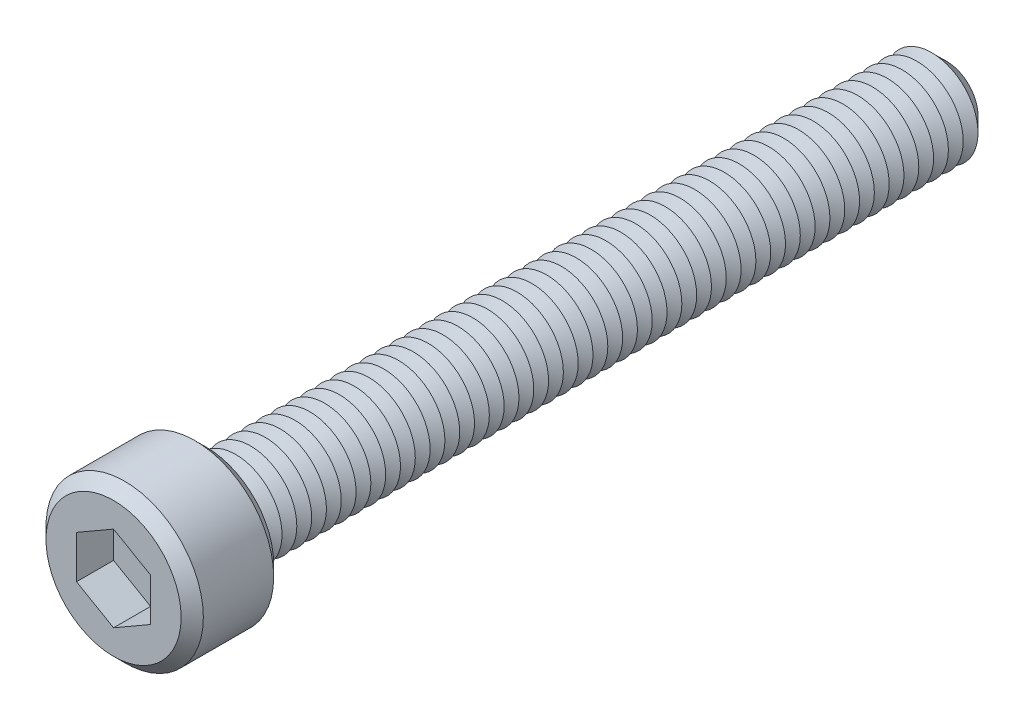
ISO-10303-21;
HEADER;
FILE_DESCRIPTION(('STEP AP214'),'2;1');
FILE_NAME('part.step','',(''),(''),'','','');
FILE_SCHEMA(('AUTOMOTIVE_DESIGN { 1 0 10303 214 1 1 1 1 }'));
ENDSEC;
DATA;
#1=APPLICATION_CONTEXT('core data for automotive mechanical design processes');
#2=APPLICATION_PROTOCOL_DEFINITION('international standard','automotive_design',2000,#1);
#3=PRODUCT_CONTEXT('',#1,'mechanical');
#4=PRODUCT('Part','Part','',(#3));
#5=PRODUCT_RELATED_PRODUCT_CATEGORY('part','',(#4));
#6=PRODUCT_DEFINITION_FORMATION('','',#4);
#7=PRODUCT_DEFINITION_CONTEXT('part definition',#1,'design');
#8=PRODUCT_DEFINITION('design','',#6,#7);
#9=PRODUCT_DEFINITION_SHAPE('','',#8);
#10=(LENGTH_UNIT() NAMED_UNIT(*) SI_UNIT(.MILLI.,.METRE.));
#11=(NAMED_UNIT(*) PLANE_ANGLE_UNIT() SI_UNIT($,.RADIAN.));
#12=(NAMED_UNIT(*) SI_UNIT($,.STERADIAN.) SOLID_ANGLE_UNIT());
#13=UNCERTAINTY_MEASURE_WITH_UNIT(LENGTH_MEASURE(1.E-05),#10,'distance_accuracy_value','');
#14=(GEOMETRIC_REPRESENTATION_CONTEXT(3) GLOBAL_UNCERTAINTY_ASSIGNED_CONTEXT((#13)) GLOBAL_UNIT_ASSIGNED_CONTEXT((#10,
#11,#12)) REPRESENTATION_CONTEXT('',''));
#15=CARTESIAN_POINT('',(0.,0.,0.));
#16=DIRECTION('',(0.,0.,1.));
#17=DIRECTION('',(1.,0.,0.));
#18=AXIS2_PLACEMENT_3D('',#15,#16,#17);
#19=CARTESIAN_POINT('',(0.,0.,5.));
#20=DIRECTION('',(0.,0.,-1.));
#21=DIRECTION('',(-1.,0.,0.));
#22=AXIS2_PLACEMENT_3D('',#19,#20,#21);
#23=CYLINDRICAL_SURFACE('',#22,4.25);
#24=CARTESIAN_POINT('',(0.,0.,0.600000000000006));
#25=DIRECTION('',(0.,0.,1.));
#26=DIRECTION('',(1.,0.,0.));
#27=AXIS2_PLACEMENT_3D('',#24,#25,#26);
#28=CIRCLE('',#27,4.25);
#29=CARTESIAN_POINT('',(4.25,0.,0.600000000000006));
#30=VERTEX_POINT('',#29);
#31=EDGE_CURVE('E568',#30,#30,#28,.T.);
#32=ORIENTED_EDGE('',*,*,#31,.T.);
#33=EDGE_LOOP('',(#32));
#34=FACE_BOUND('',#33,.T.);
#35=CARTESIAN_POINT('',(0.,0.,4.39999999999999));
#36=DIRECTION('',(0.,0.,1.));
#37=DIRECTION('',(1.,0.,0.));
#38=AXIS2_PLACEMENT_3D('',#35,#36,#37);
#39=CIRCLE('',#38,4.25);
#40=CARTESIAN_POINT('',(4.25,0.,4.39999999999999));
#41=VERTEX_POINT('',#40);
#42=EDGE_CURVE('E564',#41,#41,#39,.F.);
#43=ORIENTED_EDGE('',*,*,#42,.T.);
#44=EDGE_LOOP('',(#43));
#45=FACE_BOUND('',#44,.T.);
#46=ADVANCED_FACE('F39',(#34,#45),#23,.T.);
#47=CARTESIAN_POINT('',(0.,0.,5.));
#48=DIRECTION('',(0.,0.,1.));
#49=DIRECTION('',(1.,0.,0.));
#50=AXIS2_PLACEMENT_3D('',#47,#48,#49);
#51=PLANE('',#50);
#52=CARTESIAN_POINT('',(0.,0.,5.));
#53=DIRECTION('',(0.,0.,1.));
#54=DIRECTION('',(1.,0.,0.));
#55=AXIS2_PLACEMENT_3D('',#52,#53,#54);
#56=CIRCLE('',#55,3.65);
#57=CARTESIAN_POINT('',(3.65,0.,5.));
#58=VERTEX_POINT('',#57);
#59=EDGE_CURVE('E11',#58,#58,#56,.T.);
#60=ORIENTED_EDGE('',*,*,#59,.T.);
#61=EDGE_LOOP('',(#60));
#62=FACE_BOUND('',#61,.T.);
#63=DIRECTION('',(-0.866025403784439,0.5,0.));
#64=VECTOR('',#63,1.);
#65=CARTESIAN_POINT('',(2.,1.15470053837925,5.));
#66=LINE('',#65,#64);
#67=CARTESIAN_POINT('',(2.,1.15470053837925,5.));
#68=VERTEX_POINT('',#67);
#69=CARTESIAN_POINT('',(0.,2.3094010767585,5.));
#70=VERTEX_POINT('',#69);
#71=EDGE_CURVE('E55',#68,#70,#66,.T.);
#72=ORIENTED_EDGE('',*,*,#71,.F.);
#73=DIRECTION('',(0.,1.,0.));
#74=VECTOR('',#73,1.);
#75=CARTESIAN_POINT('',(2.,-1.15470053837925,5.));
#76=LINE('',#75,#74);
#77=CARTESIAN_POINT('',(2.,-1.15470053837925,5.));
#78=VERTEX_POINT('',#77);
#79=EDGE_CURVE('E151',#78,#68,#76,.T.);
#80=ORIENTED_EDGE('',*,*,#79,.F.);
#81=DIRECTION('',(0.866025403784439,0.5,0.));
#82=VECTOR('',#81,1.);
#83=CARTESIAN_POINT('',(0.,-2.3094010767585,5.));
#84=LINE('',#83,#82);
#85=CARTESIAN_POINT('',(0.,-2.3094010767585,5.));
#86=VERTEX_POINT('',#85);
#87=EDGE_CURVE('E148',#86,#78,#84,.T.);
#88=ORIENTED_EDGE('',*,*,#87,.F.);
#89=DIRECTION('',(0.866025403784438,-0.5,0.));
#90=VECTOR('',#89,1.);
#91=CARTESIAN_POINT('',(-2.,-1.15470053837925,5.));
#92=LINE('',#91,#90);
#93=CARTESIAN_POINT('',(-2.,-1.15470053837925,5.));
#94=VERTEX_POINT('',#93);
#95=EDGE_CURVE('E103',#94,#86,#92,.T.);
#96=ORIENTED_EDGE('',*,*,#95,.F.);
#97=DIRECTION('',(0.,-1.,0.));
#98=VECTOR('',#97,1.);
#99=CARTESIAN_POINT('',(-2.,1.15470053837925,5.));
#100=LINE('',#99,#98);
#101=CARTESIAN_POINT('',(-2.,1.15470053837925,5.));
#102=VERTEX_POINT('',#101);
#103=EDGE_CURVE('E142',#102,#94,#100,.T.);
#104=ORIENTED_EDGE('',*,*,#103,.F.);
#105=DIRECTION('',(-0.866025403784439,-0.5,0.));
#106=VECTOR('',#105,1.);
#107=CARTESIAN_POINT('',(0.,2.3094010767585,5.));
#108=LINE('',#107,#106);
#109=EDGE_CURVE('E137',#70,#102,#108,.T.);
#110=ORIENTED_EDGE('',*,*,#109,.F.);
#111=EDGE_LOOP('',(#72,#80,#88,#96,#104,#110));
#112=FACE_BOUND('',#111,.T.);
#113=ADVANCED_FACE('F586',(#62,#112),#51,.T.);
#114=CARTESIAN_POINT('',(0.,0.,0.));
#115=DIRECTION('',(0.,0.,1.));
#116=DIRECTION('',(1.,0.,0.));
#117=AXIS2_PLACEMENT_3D('',#114,#115,#116);
#118=PLANE('',#117);
#119=CARTESIAN_POINT('',(0.,0.,0.));
#120=DIRECTION('',(0.,0.,1.));
#121=DIRECTION('',(1.,0.,0.));
#122=AXIS2_PLACEMENT_3D('',#119,#120,#121);
#123=CIRCLE('',#122,3.64999999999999);
#124=CARTESIAN_POINT('',(3.64999999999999,0.,0.));
#125=VERTEX_POINT('',#124);
#126=EDGE_CURVE('E48',#125,#125,#123,.F.);
#127=ORIENTED_EDGE('',*,*,#126,.T.);
#128=EDGE_LOOP('',(#127));
#129=FACE_BOUND('',#128,.T.);
#130=CARTESIAN_POINT('',(0.,0.,0.));
#131=DIRECTION('',(0.,0.,1.));
#132=DIRECTION('',(1.,0.,0.));
#133=AXIS2_PLACEMENT_3D('',#130,#131,#132);
#134=CIRCLE('',#133,2.5);
#135=CARTESIAN_POINT('',(2.5,0.,0.));
#136=VERTEX_POINT('',#135);
#137=EDGE_CURVE('E556',#136,#136,#134,.T.);
#138=ORIENTED_EDGE('',*,*,#137,.T.);
#139=EDGE_LOOP('',(#138));
#140=FACE_BOUND('',#139,.T.);
#141=ADVANCED_FACE('F575',(#129,#140),#118,.F.);
#142=CARTESIAN_POINT('',(0.,0.,0.));
#143=DIRECTION('',(0.,0.,1.));
#144=DIRECTION('',(1.,0.,0.));
#145=AXIS2_PLACEMENT_3D('',#142,#143,#144);
#146=CONICAL_SURFACE('',#145,2.5,1.0471975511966);
#147=CARTESIAN_POINT('',(0.,0.,-0.400000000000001));
#148=DIRECTION('',(0.,0.,1.));
#149=DIRECTION('',(1.,0.,0.));
#150=AXIS2_PLACEMENT_3D('',#147,#148,#149);
#151=CIRCLE('',#150,1.80717967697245);
#152=CARTESIAN_POINT('',(1.80717967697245,0.,-0.400000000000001));
#153=VERTEX_POINT('',#152);
#154=EDGE_CURVE('E552',#153,#153,#151,.T.);
#155=ORIENTED_EDGE('',*,*,#154,.T.);
#156=EDGE_LOOP('',(#155));
#157=FACE_BOUND('',#156,.T.);
#158=ORIENTED_EDGE('',*,*,#137,.F.);
#159=EDGE_LOOP('',(#158));
#160=FACE_BOUND('',#159,.T.);
#161=ADVANCED_FACE('F1028',(#157,#160),#146,.T.);
#162=CARTESIAN_POINT('',(0.,0.,-0.400000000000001));
#163=DIRECTION('',(0.,0.,-1.));
#164=DIRECTION('',(-1.,0.,0.));
#165=AXIS2_PLACEMENT_3D('',#162,#163,#164);
#166=CONICAL_SURFACE('',#165,1.80717967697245,1.0471975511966);
#167=CARTESIAN_POINT('',(0.,0.,-0.8));
#168=DIRECTION('',(0.,0.,1.));
#169=DIRECTION('',(1.,0.,0.));
#170=AXIS2_PLACEMENT_3D('',#167,#168,#169);
#171=CIRCLE('',#170,2.5);
#172=CARTESIAN_POINT('',(2.5,0.,-0.8));
#173=VERTEX_POINT('',#172);
#174=EDGE_CURVE('E548',#173,#173,#171,.T.);
#175=ORIENTED_EDGE('',*,*,#174,.T.);
#176=EDGE_LOOP('',(#175));
#177=FACE_BOUND('',#176,.T.);
#178=ORIENTED_EDGE('',*,*,#154,.F.);
#179=EDGE_LOOP('',(#178));
#180=FACE_BOUND('',#179,.T.);
#181=ADVANCED_FACE('F1024',(#177,#180),#166,.T.);
#182=CARTESIAN_POINT('',(0.,0.,-0.8));
#183=DIRECTION('',(0.,0.,1.));
#184=DIRECTION('',(1.,0.,0.));
#185=AXIS2_PLACEMENT_3D('',#182,#183,#184);
#186=CONICAL_SURFACE('',#185,2.5,1.0471975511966);
#187=CARTESIAN_POINT('',(0.,0.,-1.2));
#188=DIRECTION('',(0.,0.,1.));
#189=DIRECTION('',(1.,0.,0.));
#190=AXIS2_PLACEMENT_3D('',#187,#188,#189);
#191=CIRCLE('',#190,1.80717967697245);
#192=CARTESIAN_POINT('',(1.80717967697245,0.,-1.2));
#193=VERTEX_POINT('',#192);
#194=EDGE_CURVE('E545',#193,#193,#191,.T.);
#195=ORIENTED_EDGE('',*,*,#194,.T.);
#196=EDGE_LOOP('',(#195));
#197=FACE_BOUND('',#196,.T.);
#198=ORIENTED_EDGE('',*,*,#174,.F.);
#199=EDGE_LOOP('',(#198));
#200=FACE_BOUND('',#199,.T.);
#201=ADVANCED_FACE('F1020',(#197,#200),#186,.T.);
#202=CARTESIAN_POINT('',(0.,0.,-1.2));
#203=DIRECTION('',(0.,0.,-1.));
#204=DIRECTION('',(-1.,0.,0.));
#205=AXIS2_PLACEMENT_3D('',#202,#203,#204);
#206=CONICAL_SURFACE('',#205,1.80717967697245,1.0471975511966);
#207=CARTESIAN_POINT('',(0.,0.,-1.6));
#208=DIRECTION('',(0.,0.,1.));
#209=DIRECTION('',(1.,0.,0.));
#210=AXIS2_PLACEMENT_3D('',#207,#208,#209);
#211=CIRCLE('',#210,2.5);
#212=CARTESIAN_POINT('',(2.5,0.,-1.6));
#213=VERTEX_POINT('',#212);
#214=EDGE_CURVE('E541',#213,#213,#211,.T.);
#215=ORIENTED_EDGE('',*,*,#214,.T.);
#216=EDGE_LOOP('',(#215));
#217=FACE_BOUND('',#216,.T.);
#218=ORIENTED_EDGE('',*,*,#194,.F.);
#219=EDGE_LOOP('',(#218));
#220=FACE_BOUND('',#219,.T.);
#221=ADVANCED_FACE('F1016',(#217,#220),#206,.T.);
#222=CARTESIAN_POINT('',(0.,0.,-1.6));
#223=DIRECTION('',(0.,0.,1.));
#224=DIRECTION('',(1.,0.,0.));
#225=AXIS2_PLACEMENT_3D('',#222,#223,#224);
#226=CONICAL_SURFACE('',#225,2.5,1.0471975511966);
#227=CARTESIAN_POINT('',(0.,0.,-2.));
#228=DIRECTION('',(0.,0.,1.));
#229=DIRECTION('',(1.,0.,0.));
#230=AXIS2_PLACEMENT_3D('',#227,#228,#229);
#231=CIRCLE('',#230,1.80717967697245);
#232=CARTESIAN_POINT('',(1.80717967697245,0.,-2.));
#233=VERTEX_POINT('',#232);
#234=EDGE_CURVE('E537',#233,#233,#231,.T.);
#235=ORIENTED_EDGE('',*,*,#234,.T.);
#236=EDGE_LOOP('',(#235));
#237=FACE_BOUND('',#236,.T.);
#238=ORIENTED_EDGE('',*,*,#214,.F.);
#239=EDGE_LOOP('',(#238));
#240=FACE_BOUND('',#239,.T.);
#241=ADVANCED_FACE('F1012',(#237,#240),#226,.T.);
#242=CARTESIAN_POINT('',(0.,0.,-2.));
#243=DIRECTION('',(0.,0.,-1.));
#244=DIRECTION('',(-1.,0.,0.));
#245=AXIS2_PLACEMENT_3D('',#242,#243,#244);
#246=CONICAL_SURFACE('',#245,1.80717967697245,1.0471975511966);
#247=CARTESIAN_POINT('',(0.,0.,-2.4));
#248=DIRECTION('',(0.,0.,1.));
#249=DIRECTION('',(1.,0.,0.));
#250=AXIS2_PLACEMENT_3D('',#247,#248,#249);
#251=CIRCLE('',#250,2.5);
#252=CARTESIAN_POINT('',(2.5,0.,-2.4));
#253=VERTEX_POINT('',#252);
#254=EDGE_CURVE('E533',#253,#253,#251,.T.);
#255=ORIENTED_EDGE('',*,*,#254,.T.);
#256=EDGE_LOOP('',(#255));
#257=FACE_BOUND('',#256,.T.);
#258=ORIENTED_EDGE('',*,*,#234,.F.);
#259=EDGE_LOOP('',(#258));
#260=FACE_BOUND('',#259,.T.);
#261=ADVANCED_FACE('F1008',(#257,#260),#246,.T.);
#262=CARTESIAN_POINT('',(0.,0.,-2.4));
#263=DIRECTION('',(0.,0.,1.));
#264=DIRECTION('',(1.,0.,0.));
#265=AXIS2_PLACEMENT_3D('',#262,#263,#264);
#266=CONICAL_SURFACE('',#265,2.5,1.0471975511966);
#267=CARTESIAN_POINT('',(0.,0.,-2.8));
#268=DIRECTION('',(0.,0.,1.));
#269=DIRECTION('',(1.,0.,0.));
#270=AXIS2_PLACEMENT_3D('',#267,#268,#269);
#271=CIRCLE('',#270,1.80717967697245);
#272=CARTESIAN_POINT('',(1.80717967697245,0.,-2.8));
#273=VERTEX_POINT('',#272);
#274=EDGE_CURVE('E529',#273,#273,#271,.T.);
#275=ORIENTED_EDGE('',*,*,#274,.T.);
#276=EDGE_LOOP('',(#275));
#277=FACE_BOUND('',#276,.T.);
#278=ORIENTED_EDGE('',*,*,#254,.F.);
#279=EDGE_LOOP('',(#278));
#280=FACE_BOUND('',#279,.T.);
#281=ADVANCED_FACE('F1004',(#277,#280),#266,.T.);
#282=CARTESIAN_POINT('',(0.,0.,-2.8));
#283=DIRECTION('',(0.,0.,-1.));
#284=DIRECTION('',(-1.,0.,0.));
#285=AXIS2_PLACEMENT_3D('',#282,#283,#284);
#286=CONICAL_SURFACE('',#285,1.80717967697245,1.0471975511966);
#287=CARTESIAN_POINT('',(0.,0.,-3.2));
#288=DIRECTION('',(0.,0.,1.));
#289=DIRECTION('',(1.,0.,0.));
#290=AXIS2_PLACEMENT_3D('',#287,#288,#289);
#291=CIRCLE('',#290,2.5);
#292=CARTESIAN_POINT('',(2.5,0.,-3.2));
#293=VERTEX_POINT('',#292);
#294=EDGE_CURVE('E525',#293,#293,#291,.T.);
#295=ORIENTED_EDGE('',*,*,#294,.T.);
#296=EDGE_LOOP('',(#295));
#297=FACE_BOUND('',#296,.T.);
#298=ORIENTED_EDGE('',*,*,#274,.F.);
#299=EDGE_LOOP('',(#298));
#300=FACE_BOUND('',#299,.T.);
#301=ADVANCED_FACE('F1000',(#297,#300),#286,.T.);
#302=CARTESIAN_POINT('',(0.,0.,-3.2));
#303=DIRECTION('',(0.,0.,1.));
#304=DIRECTION('',(1.,0.,0.));
#305=AXIS2_PLACEMENT_3D('',#302,#303,#304);
#306=CONICAL_SURFACE('',#305,2.5,1.0471975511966);
#307=CARTESIAN_POINT('',(0.,0.,-3.6));
#308=DIRECTION('',(0.,0.,1.));
#309=DIRECTION('',(1.,0.,0.));
#310=AXIS2_PLACEMENT_3D('',#307,#308,#309);
#311=CIRCLE('',#310,1.80717967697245);
#312=CARTESIAN_POINT('',(1.80717967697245,0.,-3.6));
#313=VERTEX_POINT('',#312);
#314=EDGE_CURVE('E521',#313,#313,#311,.T.);
#315=ORIENTED_EDGE('',*,*,#314,.T.);
#316=EDGE_LOOP('',(#315));
#317=FACE_BOUND('',#316,.T.);
#318=ORIENTED_EDGE('',*,*,#294,.F.);
#319=EDGE_LOOP('',(#318));
#320=FACE_BOUND('',#319,.T.);
#321=ADVANCED_FACE('F996',(#317,#320),#306,.T.);
#322=CARTESIAN_POINT('',(0.,0.,-3.6));
#323=DIRECTION('',(0.,0.,-1.));
#324=DIRECTION('',(-1.,0.,0.));
#325=AXIS2_PLACEMENT_3D('',#322,#323,#324);
#326=CONICAL_SURFACE('',#325,1.80717967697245,1.0471975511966);
#327=CARTESIAN_POINT('',(0.,0.,-4.));
#328=DIRECTION('',(0.,0.,1.));
#329=DIRECTION('',(1.,0.,0.));
#330=AXIS2_PLACEMENT_3D('',#327,#328,#329);
#331=CIRCLE('',#330,2.5);
#332=CARTESIAN_POINT('',(2.5,0.,-4.));
#333=VERTEX_POINT('',#332);
#334=EDGE_CURVE('E517',#333,#333,#331,.T.);
#335=ORIENTED_EDGE('',*,*,#334,.T.);
#336=EDGE_LOOP('',(#335));
#337=FACE_BOUND('',#336,.T.);
#338=ORIENTED_EDGE('',*,*,#314,.F.);
#339=EDGE_LOOP('',(#338));
#340=FACE_BOUND('',#339,.T.);
#341=ADVANCED_FACE('F992',(#337,#340),#326,.T.);
#342=CARTESIAN_POINT('',(0.,0.,-4.));
#343=DIRECTION('',(0.,0.,1.));
#344=DIRECTION('',(1.,0.,0.));
#345=AXIS2_PLACEMENT_3D('',#342,#343,#344);
#346=CONICAL_SURFACE('',#345,2.5,1.0471975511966);
#347=CARTESIAN_POINT('',(0.,0.,-4.4));
#348=DIRECTION('',(0.,0.,1.));
#349=DIRECTION('',(1.,0.,0.));
#350=AXIS2_PLACEMENT_3D('',#347,#348,#349);
#351=CIRCLE('',#350,1.80717967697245);
#352=CARTESIAN_POINT('',(1.80717967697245,0.,-4.4));
#353=VERTEX_POINT('',#352);
#354=EDGE_CURVE('E513',#353,#353,#351,.T.);
#355=ORIENTED_EDGE('',*,*,#354,.T.);
#356=EDGE_LOOP('',(#355));
#357=FACE_BOUND('',#356,.T.);
#358=ORIENTED_EDGE('',*,*,#334,.F.);
#359=EDGE_LOOP('',(#358));
#360=FACE_BOUND('',#359,.T.);
#361=ADVANCED_FACE('F988',(#357,#360),#346,.T.);
#362=CARTESIAN_POINT('',(0.,0.,-4.4));
#363=DIRECTION('',(0.,0.,-1.));
#364=DIRECTION('',(-1.,0.,0.));
#365=AXIS2_PLACEMENT_3D('',#362,#363,#364);
#366=CONICAL_SURFACE('',#365,1.80717967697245,1.0471975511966);
#367=CARTESIAN_POINT('',(0.,0.,-4.8));
#368=DIRECTION('',(0.,0.,1.));
#369=DIRECTION('',(1.,0.,0.));
#370=AXIS2_PLACEMENT_3D('',#367,#368,#369);
#371=CIRCLE('',#370,2.5);
#372=CARTESIAN_POINT('',(2.5,0.,-4.8));
#373=VERTEX_POINT('',#372);
#374=EDGE_CURVE('E509',#373,#373,#371,.T.);
#375=ORIENTED_EDGE('',*,*,#374,.T.);
#376=EDGE_LOOP('',(#375));
#377=FACE_BOUND('',#376,.T.);
#378=ORIENTED_EDGE('',*,*,#354,.F.);
#379=EDGE_LOOP('',(#378));
#380=FACE_BOUND('',#379,.T.);
#381=ADVANCED_FACE('F984',(#377,#380),#366,.T.);
#382=CARTESIAN_POINT('',(0.,0.,-4.8));
#383=DIRECTION('',(0.,0.,1.));
#384=DIRECTION('',(1.,0.,0.));
#385=AXIS2_PLACEMENT_3D('',#382,#383,#384);
#386=CONICAL_SURFACE('',#385,2.5,1.0471975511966);
#387=CARTESIAN_POINT('',(0.,0.,-5.2));
#388=DIRECTION('',(0.,0.,1.));
#389=DIRECTION('',(1.,0.,0.));
#390=AXIS2_PLACEMENT_3D('',#387,#388,#389);
#391=CIRCLE('',#390,1.80717967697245);
#392=CARTESIAN_POINT('',(1.80717967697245,0.,-5.2));
#393=VERTEX_POINT('',#392);
#394=EDGE_CURVE('E505',#393,#393,#391,.T.);
#395=ORIENTED_EDGE('',*,*,#394,.T.);
#396=EDGE_LOOP('',(#395));
#397=FACE_BOUND('',#396,.T.);
#398=ORIENTED_EDGE('',*,*,#374,.F.);
#399=EDGE_LOOP('',(#398));
#400=FACE_BOUND('',#399,.T.);
#401=ADVANCED_FACE('F980',(#397,#400),#386,.T.);
#402=CARTESIAN_POINT('',(0.,0.,-5.2));
#403=DIRECTION('',(0.,0.,-1.));
#404=DIRECTION('',(-1.,0.,0.));
#405=AXIS2_PLACEMENT_3D('',#402,#403,#404);
#406=CONICAL_SURFACE('',#405,1.80717967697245,1.0471975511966);
#407=CARTESIAN_POINT('',(0.,0.,-5.6));
#408=DIRECTION('',(0.,0.,1.));
#409=DIRECTION('',(1.,0.,0.));
#410=AXIS2_PLACEMENT_3D('',#407,#408,#409);
#411=CIRCLE('',#410,2.5);
#412=CARTESIAN_POINT('',(2.5,0.,-5.6));
#413=VERTEX_POINT('',#412);
#414=EDGE_CURVE('E501',#413,#413,#411,.T.);
#415=ORIENTED_EDGE('',*,*,#414,.T.);
#416=EDGE_LOOP('',(#415));
#417=FACE_BOUND('',#416,.T.);
#418=ORIENTED_EDGE('',*,*,#394,.F.);
#419=EDGE_LOOP('',(#418));
#420=FACE_BOUND('',#419,.T.);
#421=ADVANCED_FACE('F976',(#417,#420),#406,.T.);
#422=CARTESIAN_POINT('',(0.,0.,-5.6));
#423=DIRECTION('',(0.,0.,1.));
#424=DIRECTION('',(1.,0.,0.));
#425=AXIS2_PLACEMENT_3D('',#422,#423,#424);
#426=CONICAL_SURFACE('',#425,2.5,1.0471975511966);
#427=CARTESIAN_POINT('',(0.,0.,-6.));
#428=DIRECTION('',(0.,0.,1.));
#429=DIRECTION('',(1.,0.,0.));
#430=AXIS2_PLACEMENT_3D('',#427,#428,#429);
#431=CIRCLE('',#430,1.80717967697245);
#432=CARTESIAN_POINT('',(1.80717967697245,0.,-6.));
#433=VERTEX_POINT('',#432);
#434=EDGE_CURVE('E497',#433,#433,#431,.T.);
#435=ORIENTED_EDGE('',*,*,#434,.T.);
#436=EDGE_LOOP('',(#435));
#437=FACE_BOUND('',#436,.T.);
#438=ORIENTED_EDGE('',*,*,#414,.F.);
#439=EDGE_LOOP('',(#438));
#440=FACE_BOUND('',#439,.T.);
#441=ADVANCED_FACE('F972',(#437,#440),#426,.T.);
#442=CARTESIAN_POINT('',(0.,0.,-6.));
#443=DIRECTION('',(0.,0.,-1.));
#444=DIRECTION('',(-1.,0.,0.));
#445=AXIS2_PLACEMENT_3D('',#442,#443,#444);
#446=CONICAL_SURFACE('',#445,1.80717967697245,1.0471975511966);
#447=CARTESIAN_POINT('',(0.,0.,-6.4));
#448=DIRECTION('',(0.,0.,1.));
#449=DIRECTION('',(1.,0.,0.));
#450=AXIS2_PLACEMENT_3D('',#447,#448,#449);
#451=CIRCLE('',#450,2.5);
#452=CARTESIAN_POINT('',(2.5,0.,-6.4));
#453=VERTEX_POINT('',#452);
#454=EDGE_CURVE('E493',#453,#453,#451,.T.);
#455=ORIENTED_EDGE('',*,*,#454,.T.);
#456=EDGE_LOOP('',(#455));
#457=FACE_BOUND('',#456,.T.);
#458=ORIENTED_EDGE('',*,*,#434,.F.);
#459=EDGE_LOOP('',(#458));
#460=FACE_BOUND('',#459,.T.);
#461=ADVANCED_FACE('F968',(#457,#460),#446,.T.);
#462=CARTESIAN_POINT('',(0.,0.,-6.4));
#463=DIRECTION('',(0.,0.,1.));
#464=DIRECTION('',(1.,0.,0.));
#465=AXIS2_PLACEMENT_3D('',#462,#463,#464);
#466=CONICAL_SURFACE('',#465,2.5,1.0471975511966);
#467=CARTESIAN_POINT('',(0.,0.,-6.8));
#468=DIRECTION('',(0.,0.,1.));
#469=DIRECTION('',(1.,0.,0.));
#470=AXIS2_PLACEMENT_3D('',#467,#468,#469);
#471=CIRCLE('',#470,1.80717967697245);
#472=CARTESIAN_POINT('',(1.80717967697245,0.,-6.8));
#473=VERTEX_POINT('',#472);
#474=EDGE_CURVE('E489',#473,#473,#471,.T.);
#475=ORIENTED_EDGE('',*,*,#474,.T.);
#476=EDGE_LOOP('',(#475));
#477=FACE_BOUND('',#476,.T.);
#478=ORIENTED_EDGE('',*,*,#454,.F.);
#479=EDGE_LOOP('',(#478));
#480=FACE_BOUND('',#479,.T.);
#481=ADVANCED_FACE('F964',(#477,#480),#466,.T.);
#482=CARTESIAN_POINT('',(0.,0.,-6.8));
#483=DIRECTION('',(0.,0.,-1.));
#484=DIRECTION('',(-1.,0.,0.));
#485=AXIS2_PLACEMENT_3D('',#482,#483,#484);
#486=CONICAL_SURFACE('',#485,1.80717967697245,1.0471975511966);
#487=CARTESIAN_POINT('',(0.,0.,-7.2));
#488=DIRECTION('',(0.,0.,1.));
#489=DIRECTION('',(1.,0.,0.));
#490=AXIS2_PLACEMENT_3D('',#487,#488,#489);
#491=CIRCLE('',#490,2.5);
#492=CARTESIAN_POINT('',(2.5,0.,-7.2));
#493=VERTEX_POINT('',#492);
#494=EDGE_CURVE('E485',#493,#493,#491,.T.);
#495=ORIENTED_EDGE('',*,*,#494,.T.);
#496=EDGE_LOOP('',(#495));
#497=FACE_BOUND('',#496,.T.);
#498=ORIENTED_EDGE('',*,*,#474,.F.);
#499=EDGE_LOOP('',(#498));
#500=FACE_BOUND('',#499,.T.);
#501=ADVANCED_FACE('F960',(#497,#500),#486,.T.);
#502=CARTESIAN_POINT('',(0.,0.,-7.2));
#503=DIRECTION('',(0.,0.,1.));
#504=DIRECTION('',(1.,0.,0.));
#505=AXIS2_PLACEMENT_3D('',#502,#503,#504);
#506=CONICAL_SURFACE('',#505,2.5,1.0471975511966);
#507=CARTESIAN_POINT('',(0.,0.,-7.6));
#508=DIRECTION('',(0.,0.,1.));
#509=DIRECTION('',(1.,0.,0.));
#510=AXIS2_PLACEMENT_3D('',#507,#508,#509);
#511=CIRCLE('',#510,1.80717967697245);
#512=CARTESIAN_POINT('',(1.80717967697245,0.,-7.6));
#513=VERTEX_POINT('',#512);
#514=EDGE_CURVE('E481',#513,#513,#511,.T.);
#515=ORIENTED_EDGE('',*,*,#514,.T.);
#516=EDGE_LOOP('',(#515));
#517=FACE_BOUND('',#516,.T.);
#518=ORIENTED_EDGE('',*,*,#494,.F.);
#519=EDGE_LOOP('',(#518));
#520=FACE_BOUND('',#519,.T.);
#521=ADVANCED_FACE('F956',(#517,#520),#506,.T.);
#522=CARTESIAN_POINT('',(0.,0.,-7.6));
#523=DIRECTION('',(0.,0.,-1.));
#524=DIRECTION('',(-1.,0.,0.));
#525=AXIS2_PLACEMENT_3D('',#522,#523,#524);
#526=CONICAL_SURFACE('',#525,1.80717967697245,1.0471975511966);
#527=CARTESIAN_POINT('',(0.,0.,-8.));
#528=DIRECTION('',(0.,0.,1.));
#529=DIRECTION('',(1.,0.,0.));
#530=AXIS2_PLACEMENT_3D('',#527,#528,#529);
#531=CIRCLE('',#530,2.5);
#532=CARTESIAN_POINT('',(2.5,0.,-8.));
#533=VERTEX_POINT('',#532);
#534=EDGE_CURVE('E477',#533,#533,#531,.T.);
#535=ORIENTED_EDGE('',*,*,#534,.T.);
#536=EDGE_LOOP('',(#535));
#537=FACE_BOUND('',#536,.T.);
#538=ORIENTED_EDGE('',*,*,#514,.F.);
#539=EDGE_LOOP('',(#538));
#540=FACE_BOUND('',#539,.T.);
#541=ADVANCED_FACE('F952',(#537,#540),#526,.T.);
#542=CARTESIAN_POINT('',(0.,0.,-8.));
#543=DIRECTION('',(0.,0.,1.));
#544=DIRECTION('',(1.,0.,0.));
#545=AXIS2_PLACEMENT_3D('',#542,#543,#544);
#546=CONICAL_SURFACE('',#545,2.5,1.0471975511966);
#547=CARTESIAN_POINT('',(0.,0.,-8.4));
#548=DIRECTION('',(0.,0.,1.));
#549=DIRECTION('',(1.,0.,0.));
#550=AXIS2_PLACEMENT_3D('',#547,#548,#549);
#551=CIRCLE('',#550,1.80717967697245);
#552=CARTESIAN_POINT('',(1.80717967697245,0.,-8.4));
#553=VERTEX_POINT('',#552);
#554=EDGE_CURVE('E473',#553,#553,#551,.T.);
#555=ORIENTED_EDGE('',*,*,#554,.T.);
#556=EDGE_LOOP('',(#555));
#557=FACE_BOUND('',#556,.T.);
#558=ORIENTED_EDGE('',*,*,#534,.F.);
#559=EDGE_LOOP('',(#558));
#560=FACE_BOUND('',#559,.T.);
#561=ADVANCED_FACE('F948',(#557,#560),#546,.T.);
#562=CARTESIAN_POINT('',(0.,0.,-8.4));
#563=DIRECTION('',(0.,0.,-1.));
#564=DIRECTION('',(-1.,0.,0.));
#565=AXIS2_PLACEMENT_3D('',#562,#563,#564);
#566=CONICAL_SURFACE('',#565,1.80717967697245,1.0471975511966);
#567=CARTESIAN_POINT('',(0.,0.,-8.8));
#568=DIRECTION('',(0.,0.,1.));
#569=DIRECTION('',(1.,0.,0.));
#570=AXIS2_PLACEMENT_3D('',#567,#568,#569);
#571=CIRCLE('',#570,2.5);
#572=CARTESIAN_POINT('',(2.5,0.,-8.8));
#573=VERTEX_POINT('',#572);
#574=EDGE_CURVE('E469',#573,#573,#571,.T.);
#575=ORIENTED_EDGE('',*,*,#574,.T.);
#576=EDGE_LOOP('',(#575));
#577=FACE_BOUND('',#576,.T.);
#578=ORIENTED_EDGE('',*,*,#554,.F.);
#579=EDGE_LOOP('',(#578));
#580=FACE_BOUND('',#579,.T.);
#581=ADVANCED_FACE('F944',(#577,#580),#566,.T.);
#582=CARTESIAN_POINT('',(0.,0.,-8.8));
#583=DIRECTION('',(0.,0.,1.));
#584=DIRECTION('',(1.,0.,0.));
#585=AXIS2_PLACEMENT_3D('',#582,#583,#584);
#586=CONICAL_SURFACE('',#585,2.5,1.0471975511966);
#587=CARTESIAN_POINT('',(0.,0.,-9.2));
#588=DIRECTION('',(0.,0.,1.));
#589=DIRECTION('',(1.,0.,0.));
#590=AXIS2_PLACEMENT_3D('',#587,#588,#589);
#591=CIRCLE('',#590,1.80717967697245);
#592=CARTESIAN_POINT('',(1.80717967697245,0.,-9.2));
#593=VERTEX_POINT('',#592);
#594=EDGE_CURVE('E465',#593,#593,#591,.T.);
#595=ORIENTED_EDGE('',*,*,#594,.T.);
#596=EDGE_LOOP('',(#595));
#597=FACE_BOUND('',#596,.T.);
#598=ORIENTED_EDGE('',*,*,#574,.F.);
#599=EDGE_LOOP('',(#598));
#600=FACE_BOUND('',#599,.T.);
#601=ADVANCED_FACE('F940',(#597,#600),#586,.T.);
#602=CARTESIAN_POINT('',(0.,0.,-9.2));
#603=DIRECTION('',(0.,0.,-1.));
#604=DIRECTION('',(-1.,0.,0.));
#605=AXIS2_PLACEMENT_3D('',#602,#603,#604);
#606=CONICAL_SURFACE('',#605,1.80717967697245,1.0471975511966);
#607=CARTESIAN_POINT('',(0.,0.,-9.6));
#608=DIRECTION('',(0.,0.,1.));
#609=DIRECTION('',(1.,0.,0.));
#610=AXIS2_PLACEMENT_3D('',#607,#608,#609);
#611=CIRCLE('',#610,2.5);
#612=CARTESIAN_POINT('',(2.5,0.,-9.6));
#613=VERTEX_POINT('',#612);
#614=EDGE_CURVE('E461',#613,#613,#611,.T.);
#615=ORIENTED_EDGE('',*,*,#614,.T.);
#616=EDGE_LOOP('',(#615));
#617=FACE_BOUND('',#616,.T.);
#618=ORIENTED_EDGE('',*,*,#594,.F.);
#619=EDGE_LOOP('',(#618));
#620=FACE_BOUND('',#619,.T.);
#621=ADVANCED_FACE('F936',(#617,#620),#606,.T.);
#622=CARTESIAN_POINT('',(0.,0.,-9.6));
#623=DIRECTION('',(0.,0.,1.));
#624=DIRECTION('',(1.,0.,0.));
#625=AXIS2_PLACEMENT_3D('',#622,#623,#624);
#626=CONICAL_SURFACE('',#625,2.5,1.0471975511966);
#627=CARTESIAN_POINT('',(0.,0.,-10.));
#628=DIRECTION('',(0.,0.,1.));
#629=DIRECTION('',(1.,0.,0.));
#630=AXIS2_PLACEMENT_3D('',#627,#628,#629);
#631=CIRCLE('',#630,1.80717967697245);
#632=CARTESIAN_POINT('',(1.80717967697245,0.,-10.));
#633=VERTEX_POINT('',#632);
#634=EDGE_CURVE('E457',#633,#633,#631,.T.);
#635=ORIENTED_EDGE('',*,*,#634,.T.);
#636=EDGE_LOOP('',(#635));
#637=FACE_BOUND('',#636,.T.);
#638=ORIENTED_EDGE('',*,*,#614,.F.);
#639=EDGE_LOOP('',(#638));
#640=FACE_BOUND('',#639,.T.);
#641=ADVANCED_FACE('F932',(#637,#640),#626,.T.);
#642=CARTESIAN_POINT('',(0.,0.,-10.));
#643=DIRECTION('',(0.,0.,-1.));
#644=DIRECTION('',(-1.,0.,0.));
#645=AXIS2_PLACEMENT_3D('',#642,#643,#644);
#646=CONICAL_SURFACE('',#645,1.80717967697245,1.0471975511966);
#647=CARTESIAN_POINT('',(0.,0.,-10.4));
#648=DIRECTION('',(0.,0.,1.));
#649=DIRECTION('',(1.,0.,0.));
#650=AXIS2_PLACEMENT_3D('',#647,#648,#649);
#651=CIRCLE('',#650,2.5);
#652=CARTESIAN_POINT('',(2.5,0.,-10.4));
#653=VERTEX_POINT('',#652);
#654=EDGE_CURVE('E453',#653,#653,#651,.T.);
#655=ORIENTED_EDGE('',*,*,#654,.T.);
#656=EDGE_LOOP('',(#655));
#657=FACE_BOUND('',#656,.T.);
#658=ORIENTED_EDGE('',*,*,#634,.F.);
#659=EDGE_LOOP('',(#658));
#660=FACE_BOUND('',#659,.T.);
#661=ADVANCED_FACE('F928',(#657,#660),#646,.T.);
#662=CARTESIAN_POINT('',(0.,0.,-10.4));
#663=DIRECTION('',(0.,0.,1.));
#664=DIRECTION('',(1.,0.,0.));
#665=AXIS2_PLACEMENT_3D('',#662,#663,#664);
#666=CONICAL_SURFACE('',#665,2.5,1.0471975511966);
#667=CARTESIAN_POINT('',(0.,0.,-10.8));
#668=DIRECTION('',(0.,0.,1.));
#669=DIRECTION('',(1.,0.,0.));
#670=AXIS2_PLACEMENT_3D('',#667,#668,#669);
#671=CIRCLE('',#670,1.80717967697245);
#672=CARTESIAN_POINT('',(1.80717967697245,0.,-10.8));
#673=VERTEX_POINT('',#672);
#674=EDGE_CURVE('E449',#673,#673,#671,.T.);
#675=ORIENTED_EDGE('',*,*,#674,.T.);
#676=EDGE_LOOP('',(#675));
#677=FACE_BOUND('',#676,.T.);
#678=ORIENTED_EDGE('',*,*,#654,.F.);
#679=EDGE_LOOP('',(#678));
#680=FACE_BOUND('',#679,.T.);
#681=ADVANCED_FACE('F924',(#677,#680),#666,.T.);
#682=CARTESIAN_POINT('',(0.,0.,-10.8));
#683=DIRECTION('',(0.,0.,-1.));
#684=DIRECTION('',(-1.,0.,0.));
#685=AXIS2_PLACEMENT_3D('',#682,#683,#684);
#686=CONICAL_SURFACE('',#685,1.80717967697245,1.0471975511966);
#687=CARTESIAN_POINT('',(0.,0.,-11.2));
#688=DIRECTION('',(0.,0.,1.));
#689=DIRECTION('',(1.,0.,0.));
#690=AXIS2_PLACEMENT_3D('',#687,#688,#689);
#691=CIRCLE('',#690,2.5);
#692=CARTESIAN_POINT('',(2.5,0.,-11.2));
#693=VERTEX_POINT('',#692);
#694=EDGE_CURVE('E445',#693,#693,#691,.T.);
#695=ORIENTED_EDGE('',*,*,#694,.T.);
#696=EDGE_LOOP('',(#695));
#697=FACE_BOUND('',#696,.T.);
#698=ORIENTED_EDGE('',*,*,#674,.F.);
#699=EDGE_LOOP('',(#698));
#700=FACE_BOUND('',#699,.T.);
#701=ADVANCED_FACE('F920',(#697,#700),#686,.T.);
#702=CARTESIAN_POINT('',(0.,0.,-11.2));
#703=DIRECTION('',(0.,0.,1.));
#704=DIRECTION('',(1.,0.,0.));
#705=AXIS2_PLACEMENT_3D('',#702,#703,#704);
#706=CONICAL_SURFACE('',#705,2.5,1.0471975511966);
#707=CARTESIAN_POINT('',(0.,0.,-11.6));
#708=DIRECTION('',(0.,0.,1.));
#709=DIRECTION('',(1.,0.,0.));
#710=AXIS2_PLACEMENT_3D('',#707,#708,#709);
#711=CIRCLE('',#710,1.80717967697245);
#712=CARTESIAN_POINT('',(1.80717967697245,0.,-11.6));
#713=VERTEX_POINT('',#712);
#714=EDGE_CURVE('E441',#713,#713,#711,.T.);
#715=ORIENTED_EDGE('',*,*,#714,.T.);
#716=EDGE_LOOP('',(#715));
#717=FACE_BOUND('',#716,.T.);
#718=ORIENTED_EDGE('',*,*,#694,.F.);
#719=EDGE_LOOP('',(#718));
#720=FACE_BOUND('',#719,.T.);
#721=ADVANCED_FACE('F916',(#717,#720),#706,.T.);
#722=CARTESIAN_POINT('',(0.,0.,-11.6));
#723=DIRECTION('',(0.,0.,-1.));
#724=DIRECTION('',(-1.,0.,0.));
#725=AXIS2_PLACEMENT_3D('',#722,#723,#724);
#726=CONICAL_SURFACE('',#725,1.80717967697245,1.0471975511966);
#727=CARTESIAN_POINT('',(0.,0.,-12.));
#728=DIRECTION('',(0.,0.,1.));
#729=DIRECTION('',(1.,0.,0.));
#730=AXIS2_PLACEMENT_3D('',#727,#728,#729);
#731=CIRCLE('',#730,2.5);
#732=CARTESIAN_POINT('',(2.5,0.,-12.));
#733=VERTEX_POINT('',#732);
#734=EDGE_CURVE('E437',#733,#733,#731,.T.);
#735=ORIENTED_EDGE('',*,*,#734,.T.);
#736=EDGE_LOOP('',(#735));
#737=FACE_BOUND('',#736,.T.);
#738=ORIENTED_EDGE('',*,*,#714,.F.);
#739=EDGE_LOOP('',(#738));
#740=FACE_BOUND('',#739,.T.);
#741=ADVANCED_FACE('F912',(#737,#740),#726,.T.);
#742=CARTESIAN_POINT('',(0.,0.,-12.));
#743=DIRECTION('',(0.,0.,1.));
#744=DIRECTION('',(1.,0.,0.));
#745=AXIS2_PLACEMENT_3D('',#742,#743,#744);
#746=CONICAL_SURFACE('',#745,2.5,1.0471975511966);
#747=CARTESIAN_POINT('',(0.,0.,-12.4));
#748=DIRECTION('',(0.,0.,1.));
#749=DIRECTION('',(1.,0.,0.));
#750=AXIS2_PLACEMENT_3D('',#747,#748,#749);
#751=CIRCLE('',#750,1.80717967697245);
#752=CARTESIAN_POINT('',(1.80717967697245,0.,-12.4));
#753=VERTEX_POINT('',#752);
#754=EDGE_CURVE('E433',#753,#753,#751,.T.);
#755=ORIENTED_EDGE('',*,*,#754,.T.);
#756=EDGE_LOOP('',(#755));
#757=FACE_BOUND('',#756,.T.);
#758=ORIENTED_EDGE('',*,*,#734,.F.);
#759=EDGE_LOOP('',(#758));
#760=FACE_BOUND('',#759,.T.);
#761=ADVANCED_FACE('F908',(#757,#760),#746,.T.);
#762=CARTESIAN_POINT('',(0.,0.,-12.4));
#763=DIRECTION('',(0.,0.,-1.));
#764=DIRECTION('',(-1.,0.,0.));
#765=AXIS2_PLACEMENT_3D('',#762,#763,#764);
#766=CONICAL_SURFACE('',#765,1.80717967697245,1.0471975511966);
#767=CARTESIAN_POINT('',(0.,0.,-12.8));
#768=DIRECTION('',(0.,0.,1.));
#769=DIRECTION('',(1.,0.,0.));
#770=AXIS2_PLACEMENT_3D('',#767,#768,#769);
#771=CIRCLE('',#770,2.5);
#772=CARTESIAN_POINT('',(2.5,0.,-12.8));
#773=VERTEX_POINT('',#772);
#774=EDGE_CURVE('E429',#773,#773,#771,.T.);
#775=ORIENTED_EDGE('',*,*,#774,.T.);
#776=EDGE_LOOP('',(#775));
#777=FACE_BOUND('',#776,.T.);
#778=ORIENTED_EDGE('',*,*,#754,.F.);
#779=EDGE_LOOP('',(#778));
#780=FACE_BOUND('',#779,.T.);
#781=ADVANCED_FACE('F904',(#777,#780),#766,.T.);
#782=CARTESIAN_POINT('',(0.,0.,-12.8));
#783=DIRECTION('',(0.,0.,1.));
#784=DIRECTION('',(1.,0.,0.));
#785=AXIS2_PLACEMENT_3D('',#782,#783,#784);
#786=CONICAL_SURFACE('',#785,2.5,1.0471975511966);
#787=CARTESIAN_POINT('',(0.,0.,-13.2));
#788=DIRECTION('',(0.,0.,1.));
#789=DIRECTION('',(1.,0.,0.));
#790=AXIS2_PLACEMENT_3D('',#787,#788,#789);
#791=CIRCLE('',#790,1.80717967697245);
#792=CARTESIAN_POINT('',(1.80717967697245,0.,-13.2));
#793=VERTEX_POINT('',#792);
#794=EDGE_CURVE('E425',#793,#793,#791,.T.);
#795=ORIENTED_EDGE('',*,*,#794,.T.);
#796=EDGE_LOOP('',(#795));
#797=FACE_BOUND('',#796,.T.);
#798=ORIENTED_EDGE('',*,*,#774,.F.);
#799=EDGE_LOOP('',(#798));
#800=FACE_BOUND('',#799,.T.);
#801=ADVANCED_FACE('F900',(#797,#800),#786,.T.);
#802=CARTESIAN_POINT('',(0.,0.,-13.2));
#803=DIRECTION('',(0.,0.,-1.));
#804=DIRECTION('',(-1.,0.,0.));
#805=AXIS2_PLACEMENT_3D('',#802,#803,#804);
#806=CONICAL_SURFACE('',#805,1.80717967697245,1.0471975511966);
#807=CARTESIAN_POINT('',(0.,0.,-13.6));
#808=DIRECTION('',(0.,0.,1.));
#809=DIRECTION('',(1.,0.,0.));
#810=AXIS2_PLACEMENT_3D('',#807,#808,#809);
#811=CIRCLE('',#810,2.5);
#812=CARTESIAN_POINT('',(2.5,0.,-13.6));
#813=VERTEX_POINT('',#812);
#814=EDGE_CURVE('E421',#813,#813,#811,.T.);
#815=ORIENTED_EDGE('',*,*,#814,.T.);
#816=EDGE_LOOP('',(#815));
#817=FACE_BOUND('',#816,.T.);
#818=ORIENTED_EDGE('',*,*,#794,.F.);
#819=EDGE_LOOP('',(#818));
#820=FACE_BOUND('',#819,.T.);
#821=ADVANCED_FACE('F896',(#817,#820),#806,.T.);
#822=CARTESIAN_POINT('',(0.,0.,-13.6));
#823=DIRECTION('',(0.,0.,1.));
#824=DIRECTION('',(1.,0.,0.));
#825=AXIS2_PLACEMENT_3D('',#822,#823,#824);
#826=CONICAL_SURFACE('',#825,2.5,1.0471975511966);
#827=CARTESIAN_POINT('',(0.,0.,-14.));
#828=DIRECTION('',(0.,0.,1.));
#829=DIRECTION('',(1.,0.,0.));
#830=AXIS2_PLACEMENT_3D('',#827,#828,#829);
#831=CIRCLE('',#830,1.80717967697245);
#832=CARTESIAN_POINT('',(1.80717967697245,0.,-14.));
#833=VERTEX_POINT('',#832);
#834=EDGE_CURVE('E417',#833,#833,#831,.T.);
#835=ORIENTED_EDGE('',*,*,#834,.T.);
#836=EDGE_LOOP('',(#835));
#837=FACE_BOUND('',#836,.T.);
#838=ORIENTED_EDGE('',*,*,#814,.F.);
#839=EDGE_LOOP('',(#838));
#840=FACE_BOUND('',#839,.T.);
#841=ADVANCED_FACE('F892',(#837,#840),#826,.T.);
#842=CARTESIAN_POINT('',(0.,0.,-14.));
#843=DIRECTION('',(0.,0.,-1.));
#844=DIRECTION('',(-1.,0.,0.));
#845=AXIS2_PLACEMENT_3D('',#842,#843,#844);
#846=CONICAL_SURFACE('',#845,1.80717967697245,1.0471975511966);
#847=CARTESIAN_POINT('',(0.,0.,-14.4));
#848=DIRECTION('',(0.,0.,1.));
#849=DIRECTION('',(1.,0.,0.));
#850=AXIS2_PLACEMENT_3D('',#847,#848,#849);
#851=CIRCLE('',#850,2.5);
#852=CARTESIAN_POINT('',(2.5,0.,-14.4));
#853=VERTEX_POINT('',#852);
#854=EDGE_CURVE('E413',#853,#853,#851,.T.);
#855=ORIENTED_EDGE('',*,*,#854,.T.);
#856=EDGE_LOOP('',(#855));
#857=FACE_BOUND('',#856,.T.);
#858=ORIENTED_EDGE('',*,*,#834,.F.);
#859=EDGE_LOOP('',(#858));
#860=FACE_BOUND('',#859,.T.);
#861=ADVANCED_FACE('F888',(#857,#860),#846,.T.);
#862=CARTESIAN_POINT('',(0.,0.,-14.4));
#863=DIRECTION('',(0.,0.,1.));
#864=DIRECTION('',(1.,0.,0.));
#865=AXIS2_PLACEMENT_3D('',#862,#863,#864);
#866=CONICAL_SURFACE('',#865,2.5,1.0471975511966);
#867=CARTESIAN_POINT('',(0.,0.,-14.8));
#868=DIRECTION('',(0.,0.,1.));
#869=DIRECTION('',(1.,0.,0.));
#870=AXIS2_PLACEMENT_3D('',#867,#868,#869);
#871=CIRCLE('',#870,1.80717967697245);
#872=CARTESIAN_POINT('',(1.80717967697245,0.,-14.8));
#873=VERTEX_POINT('',#872);
#874=EDGE_CURVE('E409',#873,#873,#871,.T.);
#875=ORIENTED_EDGE('',*,*,#874,.T.);
#876=EDGE_LOOP('',(#875));
#877=FACE_BOUND('',#876,.T.);
#878=ORIENTED_EDGE('',*,*,#854,.F.);
#879=EDGE_LOOP('',(#878));
#880=FACE_BOUND('',#879,.T.);
#881=ADVANCED_FACE('F884',(#877,#880),#866,.T.);
#882=CARTESIAN_POINT('',(0.,0.,-14.8));
#883=DIRECTION('',(0.,0.,-1.));
#884=DIRECTION('',(-1.,0.,0.));
#885=AXIS2_PLACEMENT_3D('',#882,#883,#884);
#886=CONICAL_SURFACE('',#885,1.80717967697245,1.0471975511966);
#887=CARTESIAN_POINT('',(0.,0.,-15.2));
#888=DIRECTION('',(0.,0.,1.));
#889=DIRECTION('',(1.,0.,0.));
#890=AXIS2_PLACEMENT_3D('',#887,#888,#889);
#891=CIRCLE('',#890,2.5);
#892=CARTESIAN_POINT('',(2.5,0.,-15.2));
#893=VERTEX_POINT('',#892);
#894=EDGE_CURVE('E405',#893,#893,#891,.T.);
#895=ORIENTED_EDGE('',*,*,#894,.T.);
#896=EDGE_LOOP('',(#895));
#897=FACE_BOUND('',#896,.T.);
#898=ORIENTED_EDGE('',*,*,#874,.F.);
#899=EDGE_LOOP('',(#898));
#900=FACE_BOUND('',#899,.T.);
#901=ADVANCED_FACE('F880',(#897,#900),#886,.T.);
#902=CARTESIAN_POINT('',(0.,0.,-15.2));
#903=DIRECTION('',(0.,0.,1.));
#904=DIRECTION('',(1.,0.,0.));
#905=AXIS2_PLACEMENT_3D('',#902,#903,#904);
#906=CONICAL_SURFACE('',#905,2.5,1.0471975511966);
#907=CARTESIAN_POINT('',(0.,0.,-15.6));
#908=DIRECTION('',(0.,0.,1.));
#909=DIRECTION('',(1.,0.,0.));
#910=AXIS2_PLACEMENT_3D('',#907,#908,#909);
#911=CIRCLE('',#910,1.80717967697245);
#912=CARTESIAN_POINT('',(1.80717967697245,0.,-15.6));
#913=VERTEX_POINT('',#912);
#914=EDGE_CURVE('E401',#913,#913,#911,.T.);
#915=ORIENTED_EDGE('',*,*,#914,.T.);
#916=EDGE_LOOP('',(#915));
#917=FACE_BOUND('',#916,.T.);
#918=ORIENTED_EDGE('',*,*,#894,.F.);
#919=EDGE_LOOP('',(#918));
#920=FACE_BOUND('',#919,.T.);
#921=ADVANCED_FACE('F876',(#917,#920),#906,.T.);
#922=CARTESIAN_POINT('',(0.,0.,-15.6));
#923=DIRECTION('',(0.,0.,-1.));
#924=DIRECTION('',(-1.,0.,0.));
#925=AXIS2_PLACEMENT_3D('',#922,#923,#924);
#926=CONICAL_SURFACE('',#925,1.80717967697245,1.0471975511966);
#927=CARTESIAN_POINT('',(0.,0.,-16.));
#928=DIRECTION('',(0.,0.,1.));
#929=DIRECTION('',(1.,0.,0.));
#930=AXIS2_PLACEMENT_3D('',#927,#928,#929);
#931=CIRCLE('',#930,2.5);
#932=CARTESIAN_POINT('',(2.5,0.,-16.));
#933=VERTEX_POINT('',#932);
#934=EDGE_CURVE('E397',#933,#933,#931,.T.);
#935=ORIENTED_EDGE('',*,*,#934,.T.);
#936=EDGE_LOOP('',(#935));
#937=FACE_BOUND('',#936,.T.);
#938=ORIENTED_EDGE('',*,*,#914,.F.);
#939=EDGE_LOOP('',(#938));
#940=FACE_BOUND('',#939,.T.);
#941=ADVANCED_FACE('F872',(#937,#940),#926,.T.);
#942=CARTESIAN_POINT('',(0.,0.,-16.));
#943=DIRECTION('',(0.,0.,1.));
#944=DIRECTION('',(1.,0.,0.));
#945=AXIS2_PLACEMENT_3D('',#942,#943,#944);
#946=CONICAL_SURFACE('',#945,2.5,1.0471975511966);
#947=CARTESIAN_POINT('',(0.,0.,-16.4));
#948=DIRECTION('',(0.,0.,1.));
#949=DIRECTION('',(1.,0.,0.));
#950=AXIS2_PLACEMENT_3D('',#947,#948,#949);
#951=CIRCLE('',#950,1.80717967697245);
#952=CARTESIAN_POINT('',(1.80717967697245,0.,-16.4));
#953=VERTEX_POINT('',#952);
#954=EDGE_CURVE('E393',#953,#953,#951,.T.);
#955=ORIENTED_EDGE('',*,*,#954,.T.);
#956=EDGE_LOOP('',(#955));
#957=FACE_BOUND('',#956,.T.);
#958=ORIENTED_EDGE('',*,*,#934,.F.);
#959=EDGE_LOOP('',(#958));
#960=FACE_BOUND('',#959,.T.);
#961=ADVANCED_FACE('F868',(#957,#960),#946,.T.);
#962=CARTESIAN_POINT('',(0.,0.,-16.4));
#963=DIRECTION('',(0.,0.,-1.));
#964=DIRECTION('',(-1.,0.,0.));
#965=AXIS2_PLACEMENT_3D('',#962,#963,#964);
#966=CONICAL_SURFACE('',#965,1.80717967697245,1.0471975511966);
#967=CARTESIAN_POINT('',(0.,0.,-16.8));
#968=DIRECTION('',(0.,0.,1.));
#969=DIRECTION('',(1.,0.,0.));
#970=AXIS2_PLACEMENT_3D('',#967,#968,#969);
#971=CIRCLE('',#970,2.5);
#972=CARTESIAN_POINT('',(2.5,0.,-16.8));
#973=VERTEX_POINT('',#972);
#974=EDGE_CURVE('E389',#973,#973,#971,.T.);
#975=ORIENTED_EDGE('',*,*,#974,.T.);
#976=EDGE_LOOP('',(#975));
#977=FACE_BOUND('',#976,.T.);
#978=ORIENTED_EDGE('',*,*,#954,.F.);
#979=EDGE_LOOP('',(#978));
#980=FACE_BOUND('',#979,.T.);
#981=ADVANCED_FACE('F864',(#977,#980),#966,.T.);
#982=CARTESIAN_POINT('',(0.,0.,-16.8));
#983=DIRECTION('',(0.,0.,1.));
#984=DIRECTION('',(1.,0.,0.));
#985=AXIS2_PLACEMENT_3D('',#982,#983,#984);
#986=CONICAL_SURFACE('',#985,2.5,1.0471975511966);
#987=CARTESIAN_POINT('',(0.,0.,-17.2));
#988=DIRECTION('',(0.,0.,1.));
#989=DIRECTION('',(1.,0.,0.));
#990=AXIS2_PLACEMENT_3D('',#987,#988,#989);
#991=CIRCLE('',#990,1.80717967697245);
#992=CARTESIAN_POINT('',(1.80717967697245,0.,-17.2));
#993=VERTEX_POINT('',#992);
#994=EDGE_CURVE('E385',#993,#993,#991,.T.);
#995=ORIENTED_EDGE('',*,*,#994,.T.);
#996=EDGE_LOOP('',(#995));
#997=FACE_BOUND('',#996,.T.);
#998=ORIENTED_EDGE('',*,*,#974,.F.);
#999=EDGE_LOOP('',(#998));
#1000=FACE_BOUND('',#999,.T.);
#1001=ADVANCED_FACE('F860',(#997,#1000),#986,.T.);
#1002=CARTESIAN_POINT('',(0.,0.,-17.2));
#1003=DIRECTION('',(0.,0.,-1.));
#1004=DIRECTION('',(-1.,0.,0.));
#1005=AXIS2_PLACEMENT_3D('',#1002,#1003,#1004);
#1006=CONICAL_SURFACE('',#1005,1.80717967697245,1.0471975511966);
#1007=CARTESIAN_POINT('',(0.,0.,-17.6));
#1008=DIRECTION('',(0.,0.,1.));
#1009=DIRECTION('',(1.,0.,0.));
#1010=AXIS2_PLACEMENT_3D('',#1007,#1008,#1009);
#1011=CIRCLE('',#1010,2.5);
#1012=CARTESIAN_POINT('',(2.5,0.,-17.6));
#1013=VERTEX_POINT('',#1012);
#1014=EDGE_CURVE('E381',#1013,#1013,#1011,.T.);
#1015=ORIENTED_EDGE('',*,*,#1014,.T.);
#1016=EDGE_LOOP('',(#1015));
#1017=FACE_BOUND('',#1016,.T.);
#1018=ORIENTED_EDGE('',*,*,#994,.F.);
#1019=EDGE_LOOP('',(#1018));
#1020=FACE_BOUND('',#1019,.T.);
#1021=ADVANCED_FACE('F856',(#1017,#1020),#1006,.T.);
#1022=CARTESIAN_POINT('',(0.,0.,-17.6));
#1023=DIRECTION('',(0.,0.,1.));
#1024=DIRECTION('',(1.,0.,0.));
#1025=AXIS2_PLACEMENT_3D('',#1022,#1023,#1024);
#1026=CONICAL_SURFACE('',#1025,2.5,1.0471975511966);
#1027=CARTESIAN_POINT('',(0.,0.,-18.));
#1028=DIRECTION('',(0.,0.,1.));
#1029=DIRECTION('',(1.,0.,0.));
#1030=AXIS2_PLACEMENT_3D('',#1027,#1028,#1029);
#1031=CIRCLE('',#1030,1.80717967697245);
#1032=CARTESIAN_POINT('',(1.80717967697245,0.,-18.));
#1033=VERTEX_POINT('',#1032);
#1034=EDGE_CURVE('E377',#1033,#1033,#1031,.T.);
#1035=ORIENTED_EDGE('',*,*,#1034,.T.);
#1036=EDGE_LOOP('',(#1035));
#1037=FACE_BOUND('',#1036,.T.);
#1038=ORIENTED_EDGE('',*,*,#1014,.F.);
#1039=EDGE_LOOP('',(#1038));
#1040=FACE_BOUND('',#1039,.T.);
#1041=ADVANCED_FACE('F852',(#1037,#1040),#1026,.T.);
#1042=CARTESIAN_POINT('',(0.,0.,-18.));
#1043=DIRECTION('',(0.,0.,-1.));
#1044=DIRECTION('',(-1.,0.,0.));
#1045=AXIS2_PLACEMENT_3D('',#1042,#1043,#1044);
#1046=CONICAL_SURFACE('',#1045,1.80717967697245,1.0471975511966);
#1047=CARTESIAN_POINT('',(0.,0.,-18.4));
#1048=DIRECTION('',(0.,0.,1.));
#1049=DIRECTION('',(1.,0.,0.));
#1050=AXIS2_PLACEMENT_3D('',#1047,#1048,#1049);
#1051=CIRCLE('',#1050,2.5);
#1052=CARTESIAN_POINT('',(2.5,0.,-18.4));
#1053=VERTEX_POINT('',#1052);
#1054=EDGE_CURVE('E373',#1053,#1053,#1051,.T.);
#1055=ORIENTED_EDGE('',*,*,#1054,.T.);
#1056=EDGE_LOOP('',(#1055));
#1057=FACE_BOUND('',#1056,.T.);
#1058=ORIENTED_EDGE('',*,*,#1034,.F.);
#1059=EDGE_LOOP('',(#1058));
#1060=FACE_BOUND('',#1059,.T.);
#1061=ADVANCED_FACE('F848',(#1057,#1060),#1046,.T.);
#1062=CARTESIAN_POINT('',(0.,0.,-18.4));
#1063=DIRECTION('',(0.,0.,1.));
#1064=DIRECTION('',(1.,0.,0.));
#1065=AXIS2_PLACEMENT_3D('',#1062,#1063,#1064);
#1066=CONICAL_SURFACE('',#1065,2.5,1.0471975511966);
#1067=CARTESIAN_POINT('',(0.,0.,-18.8));
#1068=DIRECTION('',(0.,0.,1.));
#1069=DIRECTION('',(1.,0.,0.));
#1070=AXIS2_PLACEMENT_3D('',#1067,#1068,#1069);
#1071=CIRCLE('',#1070,1.80717967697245);
#1072=CARTESIAN_POINT('',(1.80717967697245,0.,-18.8));
#1073=VERTEX_POINT('',#1072);
#1074=EDGE_CURVE('E369',#1073,#1073,#1071,.T.);
#1075=ORIENTED_EDGE('',*,*,#1074,.T.);
#1076=EDGE_LOOP('',(#1075));
#1077=FACE_BOUND('',#1076,.T.);
#1078=ORIENTED_EDGE('',*,*,#1054,.F.);
#1079=EDGE_LOOP('',(#1078));
#1080=FACE_BOUND('',#1079,.T.);
#1081=ADVANCED_FACE('F844',(#1077,#1080),#1066,.T.);
#1082=CARTESIAN_POINT('',(0.,0.,-18.8));
#1083=DIRECTION('',(0.,0.,-1.));
#1084=DIRECTION('',(-1.,0.,0.));
#1085=AXIS2_PLACEMENT_3D('',#1082,#1083,#1084);
#1086=CONICAL_SURFACE('',#1085,1.80717967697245,1.0471975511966);
#1087=CARTESIAN_POINT('',(0.,0.,-19.2));
#1088=DIRECTION('',(0.,0.,1.));
#1089=DIRECTION('',(1.,0.,0.));
#1090=AXIS2_PLACEMENT_3D('',#1087,#1088,#1089);
#1091=CIRCLE('',#1090,2.5);
#1092=CARTESIAN_POINT('',(2.5,0.,-19.2));
#1093=VERTEX_POINT('',#1092);
#1094=EDGE_CURVE('E365',#1093,#1093,#1091,.T.);
#1095=ORIENTED_EDGE('',*,*,#1094,.T.);
#1096=EDGE_LOOP('',(#1095));
#1097=FACE_BOUND('',#1096,.T.);
#1098=ORIENTED_EDGE('',*,*,#1074,.F.);
#1099=EDGE_LOOP('',(#1098));
#1100=FACE_BOUND('',#1099,.T.);
#1101=ADVANCED_FACE('F840',(#1097,#1100),#1086,.T.);
#1102=CARTESIAN_POINT('',(0.,0.,-19.2));
#1103=DIRECTION('',(0.,0.,1.));
#1104=DIRECTION('',(1.,0.,0.));
#1105=AXIS2_PLACEMENT_3D('',#1102,#1103,#1104);
#1106=CONICAL_SURFACE('',#1105,2.5,1.0471975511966);
#1107=CARTESIAN_POINT('',(0.,0.,-19.6));
#1108=DIRECTION('',(0.,0.,1.));
#1109=DIRECTION('',(1.,0.,0.));
#1110=AXIS2_PLACEMENT_3D('',#1107,#1108,#1109);
#1111=CIRCLE('',#1110,1.80717967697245);
#1112=CARTESIAN_POINT('',(1.80717967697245,0.,-19.6));
#1113=VERTEX_POINT('',#1112);
#1114=EDGE_CURVE('E361',#1113,#1113,#1111,.T.);
#1115=ORIENTED_EDGE('',*,*,#1114,.T.);
#1116=EDGE_LOOP('',(#1115));
#1117=FACE_BOUND('',#1116,.T.);
#1118=ORIENTED_EDGE('',*,*,#1094,.F.);
#1119=EDGE_LOOP('',(#1118));
#1120=FACE_BOUND('',#1119,.T.);
#1121=ADVANCED_FACE('F836',(#1117,#1120),#1106,.T.);
#1122=CARTESIAN_POINT('',(0.,0.,-19.6));
#1123=DIRECTION('',(0.,0.,-1.));
#1124=DIRECTION('',(-1.,0.,0.));
#1125=AXIS2_PLACEMENT_3D('',#1122,#1123,#1124);
#1126=CONICAL_SURFACE('',#1125,1.80717967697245,1.0471975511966);
#1127=CARTESIAN_POINT('',(0.,0.,-20.));
#1128=DIRECTION('',(0.,0.,1.));
#1129=DIRECTION('',(1.,0.,0.));
#1130=AXIS2_PLACEMENT_3D('',#1127,#1128,#1129);
#1131=CIRCLE('',#1130,2.5);
#1132=CARTESIAN_POINT('',(2.5,0.,-20.));
#1133=VERTEX_POINT('',#1132);
#1134=EDGE_CURVE('E357',#1133,#1133,#1131,.T.);
#1135=ORIENTED_EDGE('',*,*,#1134,.T.);
#1136=EDGE_LOOP('',(#1135));
#1137=FACE_BOUND('',#1136,.T.);
#1138=ORIENTED_EDGE('',*,*,#1114,.F.);
#1139=EDGE_LOOP('',(#1138));
#1140=FACE_BOUND('',#1139,.T.);
#1141=ADVANCED_FACE('F832',(#1137,#1140),#1126,.T.);
#1142=CARTESIAN_POINT('',(0.,0.,-20.));
#1143=DIRECTION('',(0.,0.,1.));
#1144=DIRECTION('',(1.,0.,0.));
#1145=AXIS2_PLACEMENT_3D('',#1142,#1143,#1144);
#1146=CONICAL_SURFACE('',#1145,2.5,1.0471975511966);
#1147=CARTESIAN_POINT('',(0.,0.,-20.4));
#1148=DIRECTION('',(0.,0.,1.));
#1149=DIRECTION('',(1.,0.,0.));
#1150=AXIS2_PLACEMENT_3D('',#1147,#1148,#1149);
#1151=CIRCLE('',#1150,1.80717967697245);
#1152=CARTESIAN_POINT('',(1.80717967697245,0.,-20.4));
#1153=VERTEX_POINT('',#1152);
#1154=EDGE_CURVE('E353',#1153,#1153,#1151,.T.);
#1155=ORIENTED_EDGE('',*,*,#1154,.T.);
#1156=EDGE_LOOP('',(#1155));
#1157=FACE_BOUND('',#1156,.T.);
#1158=ORIENTED_EDGE('',*,*,#1134,.F.);
#1159=EDGE_LOOP('',(#1158));
#1160=FACE_BOUND('',#1159,.T.);
#1161=ADVANCED_FACE('F828',(#1157,#1160),#1146,.T.);
#1162=CARTESIAN_POINT('',(0.,0.,-20.4));
#1163=DIRECTION('',(0.,0.,-1.));
#1164=DIRECTION('',(-1.,0.,0.));
#1165=AXIS2_PLACEMENT_3D('',#1162,#1163,#1164);
#1166=CONICAL_SURFACE('',#1165,1.80717967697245,1.0471975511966);
#1167=CARTESIAN_POINT('',(0.,0.,-20.8));
#1168=DIRECTION('',(0.,0.,1.));
#1169=DIRECTION('',(1.,0.,0.));
#1170=AXIS2_PLACEMENT_3D('',#1167,#1168,#1169);
#1171=CIRCLE('',#1170,2.5);
#1172=CARTESIAN_POINT('',(2.5,0.,-20.8));
#1173=VERTEX_POINT('',#1172);
#1174=EDGE_CURVE('E349',#1173,#1173,#1171,.T.);
#1175=ORIENTED_EDGE('',*,*,#1174,.T.);
#1176=EDGE_LOOP('',(#1175));
#1177=FACE_BOUND('',#1176,.T.);
#1178=ORIENTED_EDGE('',*,*,#1154,.F.);
#1179=EDGE_LOOP('',(#1178));
#1180=FACE_BOUND('',#1179,.T.);
#1181=ADVANCED_FACE('F824',(#1177,#1180),#1166,.T.);
#1182=CARTESIAN_POINT('',(0.,0.,-20.8));
#1183=DIRECTION('',(0.,0.,1.));
#1184=DIRECTION('',(1.,0.,0.));
#1185=AXIS2_PLACEMENT_3D('',#1182,#1183,#1184);
#1186=CONICAL_SURFACE('',#1185,2.5,1.0471975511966);
#1187=CARTESIAN_POINT('',(0.,0.,-21.2));
#1188=DIRECTION('',(0.,0.,1.));
#1189=DIRECTION('',(1.,0.,0.));
#1190=AXIS2_PLACEMENT_3D('',#1187,#1188,#1189);
#1191=CIRCLE('',#1190,1.80717967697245);
#1192=CARTESIAN_POINT('',(1.80717967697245,0.,-21.2));
#1193=VERTEX_POINT('',#1192);
#1194=EDGE_CURVE('E345',#1193,#1193,#1191,.T.);
#1195=ORIENTED_EDGE('',*,*,#1194,.T.);
#1196=EDGE_LOOP('',(#1195));
#1197=FACE_BOUND('',#1196,.T.);
#1198=ORIENTED_EDGE('',*,*,#1174,.F.);
#1199=EDGE_LOOP('',(#1198));
#1200=FACE_BOUND('',#1199,.T.);
#1201=ADVANCED_FACE('F820',(#1197,#1200),#1186,.T.);
#1202=CARTESIAN_POINT('',(0.,0.,-21.2));
#1203=DIRECTION('',(0.,0.,-1.));
#1204=DIRECTION('',(-1.,0.,0.));
#1205=AXIS2_PLACEMENT_3D('',#1202,#1203,#1204);
#1206=CONICAL_SURFACE('',#1205,1.80717967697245,1.0471975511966);
#1207=CARTESIAN_POINT('',(0.,0.,-21.6));
#1208=DIRECTION('',(0.,0.,1.));
#1209=DIRECTION('',(1.,0.,0.));
#1210=AXIS2_PLACEMENT_3D('',#1207,#1208,#1209);
#1211=CIRCLE('',#1210,2.5);
#1212=CARTESIAN_POINT('',(2.5,0.,-21.6));
#1213=VERTEX_POINT('',#1212);
#1214=EDGE_CURVE('E341',#1213,#1213,#1211,.T.);
#1215=ORIENTED_EDGE('',*,*,#1214,.T.);
#1216=EDGE_LOOP('',(#1215));
#1217=FACE_BOUND('',#1216,.T.);
#1218=ORIENTED_EDGE('',*,*,#1194,.F.);
#1219=EDGE_LOOP('',(#1218));
#1220=FACE_BOUND('',#1219,.T.);
#1221=ADVANCED_FACE('F816',(#1217,#1220),#1206,.T.);
#1222=CARTESIAN_POINT('',(0.,0.,-21.6));
#1223=DIRECTION('',(0.,0.,1.));
#1224=DIRECTION('',(1.,0.,0.));
#1225=AXIS2_PLACEMENT_3D('',#1222,#1223,#1224);
#1226=CONICAL_SURFACE('',#1225,2.5,1.0471975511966);
#1227=CARTESIAN_POINT('',(0.,0.,-22.));
#1228=DIRECTION('',(0.,0.,1.));
#1229=DIRECTION('',(1.,0.,0.));
#1230=AXIS2_PLACEMENT_3D('',#1227,#1228,#1229);
#1231=CIRCLE('',#1230,1.80717967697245);
#1232=CARTESIAN_POINT('',(1.80717967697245,0.,-22.));
#1233=VERTEX_POINT('',#1232);
#1234=EDGE_CURVE('E337',#1233,#1233,#1231,.T.);
#1235=ORIENTED_EDGE('',*,*,#1234,.T.);
#1236=EDGE_LOOP('',(#1235));
#1237=FACE_BOUND('',#1236,.T.);
#1238=ORIENTED_EDGE('',*,*,#1214,.F.);
#1239=EDGE_LOOP('',(#1238));
#1240=FACE_BOUND('',#1239,.T.);
#1241=ADVANCED_FACE('F812',(#1237,#1240),#1226,.T.);
#1242=CARTESIAN_POINT('',(0.,0.,-22.));
#1243=DIRECTION('',(0.,0.,-1.));
#1244=DIRECTION('',(-1.,0.,0.));
#1245=AXIS2_PLACEMENT_3D('',#1242,#1243,#1244);
#1246=CONICAL_SURFACE('',#1245,1.80717967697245,1.0471975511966);
#1247=CARTESIAN_POINT('',(0.,0.,-22.4));
#1248=DIRECTION('',(0.,0.,1.));
#1249=DIRECTION('',(1.,0.,0.));
#1250=AXIS2_PLACEMENT_3D('',#1247,#1248,#1249);
#1251=CIRCLE('',#1250,2.5);
#1252=CARTESIAN_POINT('',(2.5,0.,-22.4));
#1253=VERTEX_POINT('',#1252);
#1254=EDGE_CURVE('E333',#1253,#1253,#1251,.T.);
#1255=ORIENTED_EDGE('',*,*,#1254,.T.);
#1256=EDGE_LOOP('',(#1255));
#1257=FACE_BOUND('',#1256,.T.);
#1258=ORIENTED_EDGE('',*,*,#1234,.F.);
#1259=EDGE_LOOP('',(#1258));
#1260=FACE_BOUND('',#1259,.T.);
#1261=ADVANCED_FACE('F808',(#1257,#1260),#1246,.T.);
#1262=CARTESIAN_POINT('',(0.,0.,-22.4));
#1263=DIRECTION('',(0.,0.,1.));
#1264=DIRECTION('',(1.,0.,0.));
#1265=AXIS2_PLACEMENT_3D('',#1262,#1263,#1264);
#1266=CONICAL_SURFACE('',#1265,2.5,1.0471975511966);
#1267=CARTESIAN_POINT('',(0.,0.,-22.8));
#1268=DIRECTION('',(0.,0.,1.));
#1269=DIRECTION('',(1.,0.,0.));
#1270=AXIS2_PLACEMENT_3D('',#1267,#1268,#1269);
#1271=CIRCLE('',#1270,1.80717967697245);
#1272=CARTESIAN_POINT('',(1.80717967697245,0.,-22.8));
#1273=VERTEX_POINT('',#1272);
#1274=EDGE_CURVE('E329',#1273,#1273,#1271,.T.);
#1275=ORIENTED_EDGE('',*,*,#1274,.T.);
#1276=EDGE_LOOP('',(#1275));
#1277=FACE_BOUND('',#1276,.T.);
#1278=ORIENTED_EDGE('',*,*,#1254,.F.);
#1279=EDGE_LOOP('',(#1278));
#1280=FACE_BOUND('',#1279,.T.);
#1281=ADVANCED_FACE('F804',(#1277,#1280),#1266,.T.);
#1282=CARTESIAN_POINT('',(0.,0.,-22.8));
#1283=DIRECTION('',(0.,0.,-1.));
#1284=DIRECTION('',(-1.,0.,0.));
#1285=AXIS2_PLACEMENT_3D('',#1282,#1283,#1284);
#1286=CONICAL_SURFACE('',#1285,1.80717967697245,1.0471975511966);
#1287=CARTESIAN_POINT('',(0.,0.,-23.2));
#1288=DIRECTION('',(0.,0.,1.));
#1289=DIRECTION('',(1.,0.,0.));
#1290=AXIS2_PLACEMENT_3D('',#1287,#1288,#1289);
#1291=CIRCLE('',#1290,2.5);
#1292=CARTESIAN_POINT('',(2.5,0.,-23.2));
#1293=VERTEX_POINT('',#1292);
#1294=EDGE_CURVE('E325',#1293,#1293,#1291,.T.);
#1295=ORIENTED_EDGE('',*,*,#1294,.T.);
#1296=EDGE_LOOP('',(#1295));
#1297=FACE_BOUND('',#1296,.T.);
#1298=ORIENTED_EDGE('',*,*,#1274,.F.);
#1299=EDGE_LOOP('',(#1298));
#1300=FACE_BOUND('',#1299,.T.);
#1301=ADVANCED_FACE('F800',(#1297,#1300),#1286,.T.);
#1302=CARTESIAN_POINT('',(0.,0.,-23.2));
#1303=DIRECTION('',(0.,0.,1.));
#1304=DIRECTION('',(1.,0.,0.));
#1305=AXIS2_PLACEMENT_3D('',#1302,#1303,#1304);
#1306=CONICAL_SURFACE('',#1305,2.5,1.0471975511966);
#1307=CARTESIAN_POINT('',(0.,0.,-23.6));
#1308=DIRECTION('',(0.,0.,1.));
#1309=DIRECTION('',(1.,0.,0.));
#1310=AXIS2_PLACEMENT_3D('',#1307,#1308,#1309);
#1311=CIRCLE('',#1310,1.80717967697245);
#1312=CARTESIAN_POINT('',(1.80717967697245,0.,-23.6));
#1313=VERTEX_POINT('',#1312);
#1314=EDGE_CURVE('E321',#1313,#1313,#1311,.T.);
#1315=ORIENTED_EDGE('',*,*,#1314,.T.);
#1316=EDGE_LOOP('',(#1315));
#1317=FACE_BOUND('',#1316,.T.);
#1318=ORIENTED_EDGE('',*,*,#1294,.F.);
#1319=EDGE_LOOP('',(#1318));
#1320=FACE_BOUND('',#1319,.T.);
#1321=ADVANCED_FACE('F796',(#1317,#1320),#1306,.T.);
#1322=CARTESIAN_POINT('',(0.,0.,-23.6));
#1323=DIRECTION('',(0.,0.,-1.));
#1324=DIRECTION('',(-1.,0.,0.));
#1325=AXIS2_PLACEMENT_3D('',#1322,#1323,#1324);
#1326=CONICAL_SURFACE('',#1325,1.80717967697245,1.0471975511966);
#1327=CARTESIAN_POINT('',(0.,0.,-24.));
#1328=DIRECTION('',(0.,0.,1.));
#1329=DIRECTION('',(1.,0.,0.));
#1330=AXIS2_PLACEMENT_3D('',#1327,#1328,#1329);
#1331=CIRCLE('',#1330,2.5);
#1332=CARTESIAN_POINT('',(2.5,0.,-24.));
#1333=VERTEX_POINT('',#1332);
#1334=EDGE_CURVE('E317',#1333,#1333,#1331,.T.);
#1335=ORIENTED_EDGE('',*,*,#1334,.T.);
#1336=EDGE_LOOP('',(#1335));
#1337=FACE_BOUND('',#1336,.T.);
#1338=ORIENTED_EDGE('',*,*,#1314,.F.);
#1339=EDGE_LOOP('',(#1338));
#1340=FACE_BOUND('',#1339,.T.);
#1341=ADVANCED_FACE('F792',(#1337,#1340),#1326,.T.);
#1342=CARTESIAN_POINT('',(0.,0.,-24.));
#1343=DIRECTION('',(0.,0.,1.));
#1344=DIRECTION('',(1.,0.,0.));
#1345=AXIS2_PLACEMENT_3D('',#1342,#1343,#1344);
#1346=CONICAL_SURFACE('',#1345,2.5,1.0471975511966);
#1347=CARTESIAN_POINT('',(0.,0.,-24.4));
#1348=DIRECTION('',(0.,0.,1.));
#1349=DIRECTION('',(1.,0.,0.));
#1350=AXIS2_PLACEMENT_3D('',#1347,#1348,#1349);
#1351=CIRCLE('',#1350,1.80717967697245);
#1352=CARTESIAN_POINT('',(1.80717967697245,0.,-24.4));
#1353=VERTEX_POINT('',#1352);
#1354=EDGE_CURVE('E313',#1353,#1353,#1351,.T.);
#1355=ORIENTED_EDGE('',*,*,#1354,.T.);
#1356=EDGE_LOOP('',(#1355));
#1357=FACE_BOUND('',#1356,.T.);
#1358=ORIENTED_EDGE('',*,*,#1334,.F.);
#1359=EDGE_LOOP('',(#1358));
#1360=FACE_BOUND('',#1359,.T.);
#1361=ADVANCED_FACE('F788',(#1357,#1360),#1346,.T.);
#1362=CARTESIAN_POINT('',(0.,0.,-24.4));
#1363=DIRECTION('',(0.,0.,-1.));
#1364=DIRECTION('',(-1.,0.,0.));
#1365=AXIS2_PLACEMENT_3D('',#1362,#1363,#1364);
#1366=CONICAL_SURFACE('',#1365,1.80717967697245,1.0471975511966);
#1367=CARTESIAN_POINT('',(0.,0.,-24.8));
#1368=DIRECTION('',(0.,0.,1.));
#1369=DIRECTION('',(1.,0.,0.));
#1370=AXIS2_PLACEMENT_3D('',#1367,#1368,#1369);
#1371=CIRCLE('',#1370,2.5);
#1372=CARTESIAN_POINT('',(2.5,0.,-24.8));
#1373=VERTEX_POINT('',#1372);
#1374=EDGE_CURVE('E309',#1373,#1373,#1371,.T.);
#1375=ORIENTED_EDGE('',*,*,#1374,.T.);
#1376=EDGE_LOOP('',(#1375));
#1377=FACE_BOUND('',#1376,.T.);
#1378=ORIENTED_EDGE('',*,*,#1354,.F.);
#1379=EDGE_LOOP('',(#1378));
#1380=FACE_BOUND('',#1379,.T.);
#1381=ADVANCED_FACE('F784',(#1377,#1380),#1366,.T.);
#1382=CARTESIAN_POINT('',(0.,0.,-24.8));
#1383=DIRECTION('',(0.,0.,1.));
#1384=DIRECTION('',(1.,0.,0.));
#1385=AXIS2_PLACEMENT_3D('',#1382,#1383,#1384);
#1386=CONICAL_SURFACE('',#1385,2.5,1.0471975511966);
#1387=CARTESIAN_POINT('',(0.,0.,-25.2));
#1388=DIRECTION('',(0.,0.,1.));
#1389=DIRECTION('',(1.,0.,0.));
#1390=AXIS2_PLACEMENT_3D('',#1387,#1388,#1389);
#1391=CIRCLE('',#1390,1.80717967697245);
#1392=CARTESIAN_POINT('',(1.80717967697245,0.,-25.2));
#1393=VERTEX_POINT('',#1392);
#1394=EDGE_CURVE('E305',#1393,#1393,#1391,.T.);
#1395=ORIENTED_EDGE('',*,*,#1394,.T.);
#1396=EDGE_LOOP('',(#1395));
#1397=FACE_BOUND('',#1396,.T.);
#1398=ORIENTED_EDGE('',*,*,#1374,.F.);
#1399=EDGE_LOOP('',(#1398));
#1400=FACE_BOUND('',#1399,.T.);
#1401=ADVANCED_FACE('F780',(#1397,#1400),#1386,.T.);
#1402=CARTESIAN_POINT('',(0.,0.,-25.2));
#1403=DIRECTION('',(0.,0.,-1.));
#1404=DIRECTION('',(-1.,0.,0.));
#1405=AXIS2_PLACEMENT_3D('',#1402,#1403,#1404);
#1406=CONICAL_SURFACE('',#1405,1.80717967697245,1.0471975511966);
#1407=CARTESIAN_POINT('',(0.,0.,-25.6));
#1408=DIRECTION('',(0.,0.,1.));
#1409=DIRECTION('',(1.,0.,0.));
#1410=AXIS2_PLACEMENT_3D('',#1407,#1408,#1409);
#1411=CIRCLE('',#1410,2.5);
#1412=CARTESIAN_POINT('',(2.5,0.,-25.6));
#1413=VERTEX_POINT('',#1412);
#1414=EDGE_CURVE('E301',#1413,#1413,#1411,.T.);
#1415=ORIENTED_EDGE('',*,*,#1414,.T.);
#1416=EDGE_LOOP('',(#1415));
#1417=FACE_BOUND('',#1416,.T.);
#1418=ORIENTED_EDGE('',*,*,#1394,.F.);
#1419=EDGE_LOOP('',(#1418));
#1420=FACE_BOUND('',#1419,.T.);
#1421=ADVANCED_FACE('F776',(#1417,#1420),#1406,.T.);
#1422=CARTESIAN_POINT('',(0.,0.,-25.6));
#1423=DIRECTION('',(0.,0.,1.));
#1424=DIRECTION('',(1.,0.,0.));
#1425=AXIS2_PLACEMENT_3D('',#1422,#1423,#1424);
#1426=CONICAL_SURFACE('',#1425,2.5,1.0471975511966);
#1427=CARTESIAN_POINT('',(0.,0.,-26.));
#1428=DIRECTION('',(0.,0.,1.));
#1429=DIRECTION('',(1.,0.,0.));
#1430=AXIS2_PLACEMENT_3D('',#1427,#1428,#1429);
#1431=CIRCLE('',#1430,1.80717967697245);
#1432=CARTESIAN_POINT('',(1.80717967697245,0.,-26.));
#1433=VERTEX_POINT('',#1432);
#1434=EDGE_CURVE('E297',#1433,#1433,#1431,.T.);
#1435=ORIENTED_EDGE('',*,*,#1434,.T.);
#1436=EDGE_LOOP('',(#1435));
#1437=FACE_BOUND('',#1436,.T.);
#1438=ORIENTED_EDGE('',*,*,#1414,.F.);
#1439=EDGE_LOOP('',(#1438));
#1440=FACE_BOUND('',#1439,.T.);
#1441=ADVANCED_FACE('F772',(#1437,#1440),#1426,.T.);
#1442=CARTESIAN_POINT('',(0.,0.,-26.));
#1443=DIRECTION('',(0.,0.,-1.));
#1444=DIRECTION('',(-1.,0.,0.));
#1445=AXIS2_PLACEMENT_3D('',#1442,#1443,#1444);
#1446=CONICAL_SURFACE('',#1445,1.80717967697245,1.0471975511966);
#1447=CARTESIAN_POINT('',(0.,0.,-26.4));
#1448=DIRECTION('',(0.,0.,1.));
#1449=DIRECTION('',(1.,0.,0.));
#1450=AXIS2_PLACEMENT_3D('',#1447,#1448,#1449);
#1451=CIRCLE('',#1450,2.5);
#1452=CARTESIAN_POINT('',(2.5,0.,-26.4));
#1453=VERTEX_POINT('',#1452);
#1454=EDGE_CURVE('E293',#1453,#1453,#1451,.T.);
#1455=ORIENTED_EDGE('',*,*,#1454,.T.);
#1456=EDGE_LOOP('',(#1455));
#1457=FACE_BOUND('',#1456,.T.);
#1458=ORIENTED_EDGE('',*,*,#1434,.F.);
#1459=EDGE_LOOP('',(#1458));
#1460=FACE_BOUND('',#1459,.T.);
#1461=ADVANCED_FACE('F768',(#1457,#1460),#1446,.T.);
#1462=CARTESIAN_POINT('',(0.,0.,-26.4));
#1463=DIRECTION('',(0.,0.,1.));
#1464=DIRECTION('',(1.,0.,0.));
#1465=AXIS2_PLACEMENT_3D('',#1462,#1463,#1464);
#1466=CONICAL_SURFACE('',#1465,2.5,1.0471975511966);
#1467=CARTESIAN_POINT('',(0.,0.,-26.8));
#1468=DIRECTION('',(0.,0.,1.));
#1469=DIRECTION('',(1.,0.,0.));
#1470=AXIS2_PLACEMENT_3D('',#1467,#1468,#1469);
#1471=CIRCLE('',#1470,1.80717967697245);
#1472=CARTESIAN_POINT('',(1.80717967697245,0.,-26.8));
#1473=VERTEX_POINT('',#1472);
#1474=EDGE_CURVE('E289',#1473,#1473,#1471,.T.);
#1475=ORIENTED_EDGE('',*,*,#1474,.T.);
#1476=EDGE_LOOP('',(#1475));
#1477=FACE_BOUND('',#1476,.T.);
#1478=ORIENTED_EDGE('',*,*,#1454,.F.);
#1479=EDGE_LOOP('',(#1478));
#1480=FACE_BOUND('',#1479,.T.);
#1481=ADVANCED_FACE('F764',(#1477,#1480),#1466,.T.);
#1482=CARTESIAN_POINT('',(0.,0.,-26.8));
#1483=DIRECTION('',(0.,0.,-1.));
#1484=DIRECTION('',(-1.,0.,0.));
#1485=AXIS2_PLACEMENT_3D('',#1482,#1483,#1484);
#1486=CONICAL_SURFACE('',#1485,1.80717967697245,1.0471975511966);
#1487=CARTESIAN_POINT('',(0.,0.,-27.2));
#1488=DIRECTION('',(0.,0.,1.));
#1489=DIRECTION('',(1.,0.,0.));
#1490=AXIS2_PLACEMENT_3D('',#1487,#1488,#1489);
#1491=CIRCLE('',#1490,2.5);
#1492=CARTESIAN_POINT('',(2.5,0.,-27.2));
#1493=VERTEX_POINT('',#1492);
#1494=EDGE_CURVE('E285',#1493,#1493,#1491,.T.);
#1495=ORIENTED_EDGE('',*,*,#1494,.T.);
#1496=EDGE_LOOP('',(#1495));
#1497=FACE_BOUND('',#1496,.T.);
#1498=ORIENTED_EDGE('',*,*,#1474,.F.);
#1499=EDGE_LOOP('',(#1498));
#1500=FACE_BOUND('',#1499,.T.);
#1501=ADVANCED_FACE('F760',(#1497,#1500),#1486,.T.);
#1502=CARTESIAN_POINT('',(0.,0.,-27.2));
#1503=DIRECTION('',(0.,0.,1.));
#1504=DIRECTION('',(1.,0.,0.));
#1505=AXIS2_PLACEMENT_3D('',#1502,#1503,#1504);
#1506=CONICAL_SURFACE('',#1505,2.5,1.0471975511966);
#1507=CARTESIAN_POINT('',(0.,0.,-27.6));
#1508=DIRECTION('',(0.,0.,1.));
#1509=DIRECTION('',(1.,0.,0.));
#1510=AXIS2_PLACEMENT_3D('',#1507,#1508,#1509);
#1511=CIRCLE('',#1510,1.80717967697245);
#1512=CARTESIAN_POINT('',(1.80717967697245,0.,-27.6));
#1513=VERTEX_POINT('',#1512);
#1514=EDGE_CURVE('E281',#1513,#1513,#1511,.T.);
#1515=ORIENTED_EDGE('',*,*,#1514,.T.);
#1516=EDGE_LOOP('',(#1515));
#1517=FACE_BOUND('',#1516,.T.);
#1518=ORIENTED_EDGE('',*,*,#1494,.F.);
#1519=EDGE_LOOP('',(#1518));
#1520=FACE_BOUND('',#1519,.T.);
#1521=ADVANCED_FACE('F756',(#1517,#1520),#1506,.T.);
#1522=CARTESIAN_POINT('',(0.,0.,-27.6));
#1523=DIRECTION('',(0.,0.,-1.));
#1524=DIRECTION('',(-1.,0.,0.));
#1525=AXIS2_PLACEMENT_3D('',#1522,#1523,#1524);
#1526=CONICAL_SURFACE('',#1525,1.80717967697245,1.0471975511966);
#1527=CARTESIAN_POINT('',(0.,0.,-28.));
#1528=DIRECTION('',(0.,0.,1.));
#1529=DIRECTION('',(1.,0.,0.));
#1530=AXIS2_PLACEMENT_3D('',#1527,#1528,#1529);
#1531=CIRCLE('',#1530,2.5);
#1532=CARTESIAN_POINT('',(2.5,0.,-28.));
#1533=VERTEX_POINT('',#1532);
#1534=EDGE_CURVE('E277',#1533,#1533,#1531,.T.);
#1535=ORIENTED_EDGE('',*,*,#1534,.T.);
#1536=EDGE_LOOP('',(#1535));
#1537=FACE_BOUND('',#1536,.T.);
#1538=ORIENTED_EDGE('',*,*,#1514,.F.);
#1539=EDGE_LOOP('',(#1538));
#1540=FACE_BOUND('',#1539,.T.);
#1541=ADVANCED_FACE('F752',(#1537,#1540),#1526,.T.);
#1542=CARTESIAN_POINT('',(0.,0.,-28.));
#1543=DIRECTION('',(0.,0.,1.));
#1544=DIRECTION('',(1.,0.,0.));
#1545=AXIS2_PLACEMENT_3D('',#1542,#1543,#1544);
#1546=CONICAL_SURFACE('',#1545,2.5,1.0471975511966);
#1547=CARTESIAN_POINT('',(0.,0.,-28.4));
#1548=DIRECTION('',(0.,0.,1.));
#1549=DIRECTION('',(1.,0.,0.));
#1550=AXIS2_PLACEMENT_3D('',#1547,#1548,#1549);
#1551=CIRCLE('',#1550,1.80717967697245);
#1552=CARTESIAN_POINT('',(1.80717967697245,0.,-28.4));
#1553=VERTEX_POINT('',#1552);
#1554=EDGE_CURVE('E273',#1553,#1553,#1551,.T.);
#1555=ORIENTED_EDGE('',*,*,#1554,.T.);
#1556=EDGE_LOOP('',(#1555));
#1557=FACE_BOUND('',#1556,.T.);
#1558=ORIENTED_EDGE('',*,*,#1534,.F.);
#1559=EDGE_LOOP('',(#1558));
#1560=FACE_BOUND('',#1559,.T.);
#1561=ADVANCED_FACE('F748',(#1557,#1560),#1546,.T.);
#1562=CARTESIAN_POINT('',(0.,0.,-28.4));
#1563=DIRECTION('',(0.,0.,-1.));
#1564=DIRECTION('',(-1.,0.,0.));
#1565=AXIS2_PLACEMENT_3D('',#1562,#1563,#1564);
#1566=CONICAL_SURFACE('',#1565,1.80717967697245,1.0471975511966);
#1567=CARTESIAN_POINT('',(0.,0.,-28.8));
#1568=DIRECTION('',(0.,0.,1.));
#1569=DIRECTION('',(1.,0.,0.));
#1570=AXIS2_PLACEMENT_3D('',#1567,#1568,#1569);
#1571=CIRCLE('',#1570,2.5);
#1572=CARTESIAN_POINT('',(2.5,0.,-28.8));
#1573=VERTEX_POINT('',#1572);
#1574=EDGE_CURVE('E269',#1573,#1573,#1571,.T.);
#1575=ORIENTED_EDGE('',*,*,#1574,.T.);
#1576=EDGE_LOOP('',(#1575));
#1577=FACE_BOUND('',#1576,.T.);
#1578=ORIENTED_EDGE('',*,*,#1554,.F.);
#1579=EDGE_LOOP('',(#1578));
#1580=FACE_BOUND('',#1579,.T.);
#1581=ADVANCED_FACE('F744',(#1577,#1580),#1566,.T.);
#1582=CARTESIAN_POINT('',(0.,0.,-28.8));
#1583=DIRECTION('',(0.,0.,1.));
#1584=DIRECTION('',(1.,0.,0.));
#1585=AXIS2_PLACEMENT_3D('',#1582,#1583,#1584);
#1586=CONICAL_SURFACE('',#1585,2.5,1.0471975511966);
#1587=CARTESIAN_POINT('',(0.,0.,-29.2));
#1588=DIRECTION('',(0.,0.,1.));
#1589=DIRECTION('',(1.,0.,0.));
#1590=AXIS2_PLACEMENT_3D('',#1587,#1588,#1589);
#1591=CIRCLE('',#1590,1.80717967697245);
#1592=CARTESIAN_POINT('',(1.80717967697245,0.,-29.2));
#1593=VERTEX_POINT('',#1592);
#1594=EDGE_CURVE('E265',#1593,#1593,#1591,.T.);
#1595=ORIENTED_EDGE('',*,*,#1594,.T.);
#1596=EDGE_LOOP('',(#1595));
#1597=FACE_BOUND('',#1596,.T.);
#1598=ORIENTED_EDGE('',*,*,#1574,.F.);
#1599=EDGE_LOOP('',(#1598));
#1600=FACE_BOUND('',#1599,.T.);
#1601=ADVANCED_FACE('F740',(#1597,#1600),#1586,.T.);
#1602=CARTESIAN_POINT('',(0.,0.,-29.2));
#1603=DIRECTION('',(0.,0.,-1.));
#1604=DIRECTION('',(-1.,0.,0.));
#1605=AXIS2_PLACEMENT_3D('',#1602,#1603,#1604);
#1606=CONICAL_SURFACE('',#1605,1.80717967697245,1.0471975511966);
#1607=CARTESIAN_POINT('',(0.,0.,-29.6));
#1608=DIRECTION('',(0.,0.,1.));
#1609=DIRECTION('',(1.,0.,0.));
#1610=AXIS2_PLACEMENT_3D('',#1607,#1608,#1609);
#1611=CIRCLE('',#1610,2.5);
#1612=CARTESIAN_POINT('',(2.5,0.,-29.6));
#1613=VERTEX_POINT('',#1612);
#1614=EDGE_CURVE('E261',#1613,#1613,#1611,.T.);
#1615=ORIENTED_EDGE('',*,*,#1614,.T.);
#1616=EDGE_LOOP('',(#1615));
#1617=FACE_BOUND('',#1616,.T.);
#1618=ORIENTED_EDGE('',*,*,#1594,.F.);
#1619=EDGE_LOOP('',(#1618));
#1620=FACE_BOUND('',#1619,.T.);
#1621=ADVANCED_FACE('F736',(#1617,#1620),#1606,.T.);
#1622=CARTESIAN_POINT('',(0.,0.,-29.6));
#1623=DIRECTION('',(0.,0.,1.));
#1624=DIRECTION('',(1.,0.,0.));
#1625=AXIS2_PLACEMENT_3D('',#1622,#1623,#1624);
#1626=CONICAL_SURFACE('',#1625,2.5,1.0471975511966);
#1627=CARTESIAN_POINT('',(0.,0.,-30.));
#1628=DIRECTION('',(0.,0.,1.));
#1629=DIRECTION('',(1.,0.,0.));
#1630=AXIS2_PLACEMENT_3D('',#1627,#1628,#1629);
#1631=CIRCLE('',#1630,1.80717967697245);
#1632=CARTESIAN_POINT('',(1.80717967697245,0.,-30.));
#1633=VERTEX_POINT('',#1632);
#1634=EDGE_CURVE('E257',#1633,#1633,#1631,.T.);
#1635=ORIENTED_EDGE('',*,*,#1634,.T.);
#1636=EDGE_LOOP('',(#1635));
#1637=FACE_BOUND('',#1636,.T.);
#1638=ORIENTED_EDGE('',*,*,#1614,.F.);
#1639=EDGE_LOOP('',(#1638));
#1640=FACE_BOUND('',#1639,.T.);
#1641=ADVANCED_FACE('F732',(#1637,#1640),#1626,.T.);
#1642=CARTESIAN_POINT('',(0.,0.,-30.));
#1643=DIRECTION('',(0.,0.,-1.));
#1644=DIRECTION('',(-1.,0.,0.));
#1645=AXIS2_PLACEMENT_3D('',#1642,#1643,#1644);
#1646=CONICAL_SURFACE('',#1645,1.80717967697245,1.0471975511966);
#1647=CARTESIAN_POINT('',(0.,0.,-30.4));
#1648=DIRECTION('',(0.,0.,1.));
#1649=DIRECTION('',(1.,0.,0.));
#1650=AXIS2_PLACEMENT_3D('',#1647,#1648,#1649);
#1651=CIRCLE('',#1650,2.5);
#1652=CARTESIAN_POINT('',(2.5,0.,-30.4));
#1653=VERTEX_POINT('',#1652);
#1654=EDGE_CURVE('E253',#1653,#1653,#1651,.T.);
#1655=ORIENTED_EDGE('',*,*,#1654,.T.);
#1656=EDGE_LOOP('',(#1655));
#1657=FACE_BOUND('',#1656,.T.);
#1658=ORIENTED_EDGE('',*,*,#1634,.F.);
#1659=EDGE_LOOP('',(#1658));
#1660=FACE_BOUND('',#1659,.T.);
#1661=ADVANCED_FACE('F728',(#1657,#1660),#1646,.T.);
#1662=CARTESIAN_POINT('',(0.,0.,-30.4));
#1663=DIRECTION('',(0.,0.,1.));
#1664=DIRECTION('',(1.,0.,0.));
#1665=AXIS2_PLACEMENT_3D('',#1662,#1663,#1664);
#1666=CONICAL_SURFACE('',#1665,2.5,1.0471975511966);
#1667=CARTESIAN_POINT('',(0.,0.,-30.8));
#1668=DIRECTION('',(0.,0.,1.));
#1669=DIRECTION('',(1.,0.,0.));
#1670=AXIS2_PLACEMENT_3D('',#1667,#1668,#1669);
#1671=CIRCLE('',#1670,1.80717967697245);
#1672=CARTESIAN_POINT('',(1.80717967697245,0.,-30.8));
#1673=VERTEX_POINT('',#1672);
#1674=EDGE_CURVE('E249',#1673,#1673,#1671,.T.);
#1675=ORIENTED_EDGE('',*,*,#1674,.T.);
#1676=EDGE_LOOP('',(#1675));
#1677=FACE_BOUND('',#1676,.T.);
#1678=ORIENTED_EDGE('',*,*,#1654,.F.);
#1679=EDGE_LOOP('',(#1678));
#1680=FACE_BOUND('',#1679,.T.);
#1681=ADVANCED_FACE('F724',(#1677,#1680),#1666,.T.);
#1682=CARTESIAN_POINT('',(0.,0.,-30.8));
#1683=DIRECTION('',(0.,0.,-1.));
#1684=DIRECTION('',(-1.,0.,0.));
#1685=AXIS2_PLACEMENT_3D('',#1682,#1683,#1684);
#1686=CONICAL_SURFACE('',#1685,1.80717967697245,1.0471975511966);
#1687=CARTESIAN_POINT('',(0.,0.,-31.2));
#1688=DIRECTION('',(0.,0.,1.));
#1689=DIRECTION('',(1.,0.,0.));
#1690=AXIS2_PLACEMENT_3D('',#1687,#1688,#1689);
#1691=CIRCLE('',#1690,2.5);
#1692=CARTESIAN_POINT('',(2.5,0.,-31.2));
#1693=VERTEX_POINT('',#1692);
#1694=EDGE_CURVE('E245',#1693,#1693,#1691,.T.);
#1695=ORIENTED_EDGE('',*,*,#1694,.T.);
#1696=EDGE_LOOP('',(#1695));
#1697=FACE_BOUND('',#1696,.T.);
#1698=ORIENTED_EDGE('',*,*,#1674,.F.);
#1699=EDGE_LOOP('',(#1698));
#1700=FACE_BOUND('',#1699,.T.);
#1701=ADVANCED_FACE('F720',(#1697,#1700),#1686,.T.);
#1702=CARTESIAN_POINT('',(0.,0.,-31.2));
#1703=DIRECTION('',(0.,0.,1.));
#1704=DIRECTION('',(1.,0.,0.));
#1705=AXIS2_PLACEMENT_3D('',#1702,#1703,#1704);
#1706=CONICAL_SURFACE('',#1705,2.5,1.0471975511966);
#1707=CARTESIAN_POINT('',(0.,0.,-31.6));
#1708=DIRECTION('',(0.,0.,1.));
#1709=DIRECTION('',(1.,0.,0.));
#1710=AXIS2_PLACEMENT_3D('',#1707,#1708,#1709);
#1711=CIRCLE('',#1710,1.80717967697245);
#1712=CARTESIAN_POINT('',(1.80717967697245,0.,-31.6));
#1713=VERTEX_POINT('',#1712);
#1714=EDGE_CURVE('E241',#1713,#1713,#1711,.T.);
#1715=ORIENTED_EDGE('',*,*,#1714,.T.);
#1716=EDGE_LOOP('',(#1715));
#1717=FACE_BOUND('',#1716,.T.);
#1718=ORIENTED_EDGE('',*,*,#1694,.F.);
#1719=EDGE_LOOP('',(#1718));
#1720=FACE_BOUND('',#1719,.T.);
#1721=ADVANCED_FACE('F716',(#1717,#1720),#1706,.T.);
#1722=CARTESIAN_POINT('',(0.,0.,-31.6));
#1723=DIRECTION('',(0.,0.,-1.));
#1724=DIRECTION('',(-1.,0.,0.));
#1725=AXIS2_PLACEMENT_3D('',#1722,#1723,#1724);
#1726=CONICAL_SURFACE('',#1725,1.80717967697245,1.0471975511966);
#1727=CARTESIAN_POINT('',(0.,0.,-32.));
#1728=DIRECTION('',(0.,0.,1.));
#1729=DIRECTION('',(1.,0.,0.));
#1730=AXIS2_PLACEMENT_3D('',#1727,#1728,#1729);
#1731=CIRCLE('',#1730,2.5);
#1732=CARTESIAN_POINT('',(2.5,0.,-32.));
#1733=VERTEX_POINT('',#1732);
#1734=EDGE_CURVE('E237',#1733,#1733,#1731,.T.);
#1735=ORIENTED_EDGE('',*,*,#1734,.T.);
#1736=EDGE_LOOP('',(#1735));
#1737=FACE_BOUND('',#1736,.T.);
#1738=ORIENTED_EDGE('',*,*,#1714,.F.);
#1739=EDGE_LOOP('',(#1738));
#1740=FACE_BOUND('',#1739,.T.);
#1741=ADVANCED_FACE('F712',(#1737,#1740),#1726,.T.);
#1742=CARTESIAN_POINT('',(0.,0.,-32.));
#1743=DIRECTION('',(0.,0.,1.));
#1744=DIRECTION('',(1.,0.,0.));
#1745=AXIS2_PLACEMENT_3D('',#1742,#1743,#1744);
#1746=CONICAL_SURFACE('',#1745,2.5,1.0471975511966);
#1747=CARTESIAN_POINT('',(0.,0.,-32.4));
#1748=DIRECTION('',(0.,0.,1.));
#1749=DIRECTION('',(1.,0.,0.));
#1750=AXIS2_PLACEMENT_3D('',#1747,#1748,#1749);
#1751=CIRCLE('',#1750,1.80717967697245);
#1752=CARTESIAN_POINT('',(1.80717967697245,0.,-32.4));
#1753=VERTEX_POINT('',#1752);
#1754=EDGE_CURVE('E233',#1753,#1753,#1751,.T.);
#1755=ORIENTED_EDGE('',*,*,#1754,.T.);
#1756=EDGE_LOOP('',(#1755));
#1757=FACE_BOUND('',#1756,.T.);
#1758=ORIENTED_EDGE('',*,*,#1734,.F.);
#1759=EDGE_LOOP('',(#1758));
#1760=FACE_BOUND('',#1759,.T.);
#1761=ADVANCED_FACE('F708',(#1757,#1760),#1746,.T.);
#1762=CARTESIAN_POINT('',(0.,0.,-32.4));
#1763=DIRECTION('',(0.,0.,-1.));
#1764=DIRECTION('',(-1.,0.,0.));
#1765=AXIS2_PLACEMENT_3D('',#1762,#1763,#1764);
#1766=CONICAL_SURFACE('',#1765,1.80717967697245,1.0471975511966);
#1767=CARTESIAN_POINT('',(0.,0.,-32.8));
#1768=DIRECTION('',(0.,0.,1.));
#1769=DIRECTION('',(1.,0.,0.));
#1770=AXIS2_PLACEMENT_3D('',#1767,#1768,#1769);
#1771=CIRCLE('',#1770,2.5);
#1772=CARTESIAN_POINT('',(2.5,0.,-32.8));
#1773=VERTEX_POINT('',#1772);
#1774=EDGE_CURVE('E229',#1773,#1773,#1771,.T.);
#1775=ORIENTED_EDGE('',*,*,#1774,.T.);
#1776=EDGE_LOOP('',(#1775));
#1777=FACE_BOUND('',#1776,.T.);
#1778=ORIENTED_EDGE('',*,*,#1754,.F.);
#1779=EDGE_LOOP('',(#1778));
#1780=FACE_BOUND('',#1779,.T.);
#1781=ADVANCED_FACE('F704',(#1777,#1780),#1766,.T.);
#1782=CARTESIAN_POINT('',(0.,0.,-32.8));
#1783=DIRECTION('',(0.,0.,1.));
#1784=DIRECTION('',(1.,0.,0.));
#1785=AXIS2_PLACEMENT_3D('',#1782,#1783,#1784);
#1786=CONICAL_SURFACE('',#1785,2.5,1.0471975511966);
#1787=CARTESIAN_POINT('',(0.,0.,-33.2));
#1788=DIRECTION('',(0.,0.,1.));
#1789=DIRECTION('',(1.,0.,0.));
#1790=AXIS2_PLACEMENT_3D('',#1787,#1788,#1789);
#1791=CIRCLE('',#1790,1.80717967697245);
#1792=CARTESIAN_POINT('',(1.80717967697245,0.,-33.2));
#1793=VERTEX_POINT('',#1792);
#1794=EDGE_CURVE('E225',#1793,#1793,#1791,.T.);
#1795=ORIENTED_EDGE('',*,*,#1794,.T.);
#1796=EDGE_LOOP('',(#1795));
#1797=FACE_BOUND('',#1796,.T.);
#1798=ORIENTED_EDGE('',*,*,#1774,.F.);
#1799=EDGE_LOOP('',(#1798));
#1800=FACE_BOUND('',#1799,.T.);
#1801=ADVANCED_FACE('F700',(#1797,#1800),#1786,.T.);
#1802=CARTESIAN_POINT('',(0.,0.,-33.2));
#1803=DIRECTION('',(0.,0.,-1.));
#1804=DIRECTION('',(-1.,0.,0.));
#1805=AXIS2_PLACEMENT_3D('',#1802,#1803,#1804);
#1806=CONICAL_SURFACE('',#1805,1.80717967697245,1.0471975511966);
#1807=CARTESIAN_POINT('',(0.,0.,-33.6));
#1808=DIRECTION('',(0.,0.,1.));
#1809=DIRECTION('',(1.,0.,0.));
#1810=AXIS2_PLACEMENT_3D('',#1807,#1808,#1809);
#1811=CIRCLE('',#1810,2.5);
#1812=CARTESIAN_POINT('',(2.5,0.,-33.6));
#1813=VERTEX_POINT('',#1812);
#1814=EDGE_CURVE('E221',#1813,#1813,#1811,.T.);
#1815=ORIENTED_EDGE('',*,*,#1814,.T.);
#1816=EDGE_LOOP('',(#1815));
#1817=FACE_BOUND('',#1816,.T.);
#1818=ORIENTED_EDGE('',*,*,#1794,.F.);
#1819=EDGE_LOOP('',(#1818));
#1820=FACE_BOUND('',#1819,.T.);
#1821=ADVANCED_FACE('F696',(#1817,#1820),#1806,.T.);
#1822=CARTESIAN_POINT('',(0.,0.,-33.6));
#1823=DIRECTION('',(0.,0.,1.));
#1824=DIRECTION('',(1.,0.,0.));
#1825=AXIS2_PLACEMENT_3D('',#1822,#1823,#1824);
#1826=CONICAL_SURFACE('',#1825,2.5,1.0471975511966);
#1827=CARTESIAN_POINT('',(0.,0.,-34.));
#1828=DIRECTION('',(0.,0.,1.));
#1829=DIRECTION('',(1.,0.,0.));
#1830=AXIS2_PLACEMENT_3D('',#1827,#1828,#1829);
#1831=CIRCLE('',#1830,1.80717967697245);
#1832=CARTESIAN_POINT('',(1.80717967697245,0.,-34.));
#1833=VERTEX_POINT('',#1832);
#1834=EDGE_CURVE('E217',#1833,#1833,#1831,.T.);
#1835=ORIENTED_EDGE('',*,*,#1834,.T.);
#1836=EDGE_LOOP('',(#1835));
#1837=FACE_BOUND('',#1836,.T.);
#1838=ORIENTED_EDGE('',*,*,#1814,.F.);
#1839=EDGE_LOOP('',(#1838));
#1840=FACE_BOUND('',#1839,.T.);
#1841=ADVANCED_FACE('F692',(#1837,#1840),#1826,.T.);
#1842=CARTESIAN_POINT('',(0.,0.,-34.));
#1843=DIRECTION('',(0.,0.,-1.));
#1844=DIRECTION('',(-1.,0.,0.));
#1845=AXIS2_PLACEMENT_3D('',#1842,#1843,#1844);
#1846=CONICAL_SURFACE('',#1845,1.80717967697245,1.0471975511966);
#1847=CARTESIAN_POINT('',(0.,0.,-34.4));
#1848=DIRECTION('',(0.,0.,1.));
#1849=DIRECTION('',(1.,0.,0.));
#1850=AXIS2_PLACEMENT_3D('',#1847,#1848,#1849);
#1851=CIRCLE('',#1850,2.5);
#1852=CARTESIAN_POINT('',(2.5,0.,-34.4));
#1853=VERTEX_POINT('',#1852);
#1854=EDGE_CURVE('E213',#1853,#1853,#1851,.T.);
#1855=ORIENTED_EDGE('',*,*,#1854,.T.);
#1856=EDGE_LOOP('',(#1855));
#1857=FACE_BOUND('',#1856,.T.);
#1858=ORIENTED_EDGE('',*,*,#1834,.F.);
#1859=EDGE_LOOP('',(#1858));
#1860=FACE_BOUND('',#1859,.T.);
#1861=ADVANCED_FACE('F688',(#1857,#1860),#1846,.T.);
#1862=CARTESIAN_POINT('',(0.,0.,-34.4));
#1863=DIRECTION('',(0.,0.,1.));
#1864=DIRECTION('',(1.,0.,0.));
#1865=AXIS2_PLACEMENT_3D('',#1862,#1863,#1864);
#1866=CONICAL_SURFACE('',#1865,2.5,1.0471975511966);
#1867=CARTESIAN_POINT('',(0.,0.,-34.8));
#1868=DIRECTION('',(0.,0.,1.));
#1869=DIRECTION('',(1.,0.,0.));
#1870=AXIS2_PLACEMENT_3D('',#1867,#1868,#1869);
#1871=CIRCLE('',#1870,1.80717967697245);
#1872=CARTESIAN_POINT('',(1.80717967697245,0.,-34.8));
#1873=VERTEX_POINT('',#1872);
#1874=EDGE_CURVE('E209',#1873,#1873,#1871,.T.);
#1875=ORIENTED_EDGE('',*,*,#1874,.T.);
#1876=EDGE_LOOP('',(#1875));
#1877=FACE_BOUND('',#1876,.T.);
#1878=ORIENTED_EDGE('',*,*,#1854,.F.);
#1879=EDGE_LOOP('',(#1878));
#1880=FACE_BOUND('',#1879,.T.);
#1881=ADVANCED_FACE('F684',(#1877,#1880),#1866,.T.);
#1882=CARTESIAN_POINT('',(0.,0.,-34.8));
#1883=DIRECTION('',(0.,0.,-1.));
#1884=DIRECTION('',(-1.,0.,0.));
#1885=AXIS2_PLACEMENT_3D('',#1882,#1883,#1884);
#1886=CONICAL_SURFACE('',#1885,1.80717967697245,1.0471975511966);
#1887=CARTESIAN_POINT('',(0.,0.,-35.2));
#1888=DIRECTION('',(0.,0.,1.));
#1889=DIRECTION('',(1.,0.,0.));
#1890=AXIS2_PLACEMENT_3D('',#1887,#1888,#1889);
#1891=CIRCLE('',#1890,2.5);
#1892=CARTESIAN_POINT('',(2.5,0.,-35.2));
#1893=VERTEX_POINT('',#1892);
#1894=EDGE_CURVE('E205',#1893,#1893,#1891,.T.);
#1895=ORIENTED_EDGE('',*,*,#1894,.T.);
#1896=EDGE_LOOP('',(#1895));
#1897=FACE_BOUND('',#1896,.T.);
#1898=ORIENTED_EDGE('',*,*,#1874,.F.);
#1899=EDGE_LOOP('',(#1898));
#1900=FACE_BOUND('',#1899,.T.);
#1901=ADVANCED_FACE('F680',(#1897,#1900),#1886,.T.);
#1902=CARTESIAN_POINT('',(0.,0.,-35.2));
#1903=DIRECTION('',(0.,0.,1.));
#1904=DIRECTION('',(1.,0.,0.));
#1905=AXIS2_PLACEMENT_3D('',#1902,#1903,#1904);
#1906=CONICAL_SURFACE('',#1905,2.5,1.0471975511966);
#1907=CARTESIAN_POINT('',(0.,0.,-35.6));
#1908=DIRECTION('',(0.,0.,1.));
#1909=DIRECTION('',(1.,0.,0.));
#1910=AXIS2_PLACEMENT_3D('',#1907,#1908,#1909);
#1911=CIRCLE('',#1910,1.80717967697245);
#1912=CARTESIAN_POINT('',(1.80717967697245,0.,-35.6));
#1913=VERTEX_POINT('',#1912);
#1914=EDGE_CURVE('E201',#1913,#1913,#1911,.T.);
#1915=ORIENTED_EDGE('',*,*,#1914,.T.);
#1916=EDGE_LOOP('',(#1915));
#1917=FACE_BOUND('',#1916,.T.);
#1918=ORIENTED_EDGE('',*,*,#1894,.F.);
#1919=EDGE_LOOP('',(#1918));
#1920=FACE_BOUND('',#1919,.T.);
#1921=ADVANCED_FACE('F676',(#1917,#1920),#1906,.T.);
#1922=CARTESIAN_POINT('',(0.,0.,-35.6));
#1923=DIRECTION('',(0.,0.,-1.));
#1924=DIRECTION('',(-1.,0.,0.));
#1925=AXIS2_PLACEMENT_3D('',#1922,#1923,#1924);
#1926=CONICAL_SURFACE('',#1925,1.80717967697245,1.0471975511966);
#1927=CARTESIAN_POINT('',(0.,0.,-36.));
#1928=DIRECTION('',(0.,0.,1.));
#1929=DIRECTION('',(1.,0.,0.));
#1930=AXIS2_PLACEMENT_3D('',#1927,#1928,#1929);
#1931=CIRCLE('',#1930,2.5);
#1932=CARTESIAN_POINT('',(2.5,0.,-36.));
#1933=VERTEX_POINT('',#1932);
#1934=EDGE_CURVE('E197',#1933,#1933,#1931,.T.);
#1935=ORIENTED_EDGE('',*,*,#1934,.T.);
#1936=EDGE_LOOP('',(#1935));
#1937=FACE_BOUND('',#1936,.T.);
#1938=ORIENTED_EDGE('',*,*,#1914,.F.);
#1939=EDGE_LOOP('',(#1938));
#1940=FACE_BOUND('',#1939,.T.);
#1941=ADVANCED_FACE('F672',(#1937,#1940),#1926,.T.);
#1942=CARTESIAN_POINT('',(0.,0.,-36.));
#1943=DIRECTION('',(0.,0.,1.));
#1944=DIRECTION('',(1.,0.,0.));
#1945=AXIS2_PLACEMENT_3D('',#1942,#1943,#1944);
#1946=CONICAL_SURFACE('',#1945,2.5,1.0471975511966);
#1947=CARTESIAN_POINT('',(0.,0.,-36.4));
#1948=DIRECTION('',(0.,0.,1.));
#1949=DIRECTION('',(1.,0.,0.));
#1950=AXIS2_PLACEMENT_3D('',#1947,#1948,#1949);
#1951=CIRCLE('',#1950,1.80717967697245);
#1952=CARTESIAN_POINT('',(1.80717967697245,0.,-36.4));
#1953=VERTEX_POINT('',#1952);
#1954=EDGE_CURVE('E193',#1953,#1953,#1951,.T.);
#1955=ORIENTED_EDGE('',*,*,#1954,.T.);
#1956=EDGE_LOOP('',(#1955));
#1957=FACE_BOUND('',#1956,.T.);
#1958=ORIENTED_EDGE('',*,*,#1934,.F.);
#1959=EDGE_LOOP('',(#1958));
#1960=FACE_BOUND('',#1959,.T.);
#1961=ADVANCED_FACE('F668',(#1957,#1960),#1946,.T.);
#1962=CARTESIAN_POINT('',(0.,0.,-36.4));
#1963=DIRECTION('',(0.,0.,-1.));
#1964=DIRECTION('',(-1.,0.,0.));
#1965=AXIS2_PLACEMENT_3D('',#1962,#1963,#1964);
#1966=CONICAL_SURFACE('',#1965,1.80717967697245,1.0471975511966);
#1967=CARTESIAN_POINT('',(0.,0.,-36.8));
#1968=DIRECTION('',(0.,0.,1.));
#1969=DIRECTION('',(1.,0.,0.));
#1970=AXIS2_PLACEMENT_3D('',#1967,#1968,#1969);
#1971=CIRCLE('',#1970,2.5);
#1972=CARTESIAN_POINT('',(2.5,0.,-36.8));
#1973=VERTEX_POINT('',#1972);
#1974=EDGE_CURVE('E189',#1973,#1973,#1971,.T.);
#1975=ORIENTED_EDGE('',*,*,#1974,.T.);
#1976=EDGE_LOOP('',(#1975));
#1977=FACE_BOUND('',#1976,.T.);
#1978=ORIENTED_EDGE('',*,*,#1954,.F.);
#1979=EDGE_LOOP('',(#1978));
#1980=FACE_BOUND('',#1979,.T.);
#1981=ADVANCED_FACE('F664',(#1977,#1980),#1966,.T.);
#1982=CARTESIAN_POINT('',(0.,0.,-36.8));
#1983=DIRECTION('',(0.,0.,1.));
#1984=DIRECTION('',(1.,0.,0.));
#1985=AXIS2_PLACEMENT_3D('',#1982,#1983,#1984);
#1986=CONICAL_SURFACE('',#1985,2.5,1.0471975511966);
#1987=CARTESIAN_POINT('',(0.,0.,-37.2));
#1988=DIRECTION('',(0.,0.,1.));
#1989=DIRECTION('',(1.,0.,0.));
#1990=AXIS2_PLACEMENT_3D('',#1987,#1988,#1989);
#1991=CIRCLE('',#1990,1.80717967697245);
#1992=CARTESIAN_POINT('',(1.80717967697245,0.,-37.2));
#1993=VERTEX_POINT('',#1992);
#1994=EDGE_CURVE('E185',#1993,#1993,#1991,.T.);
#1995=ORIENTED_EDGE('',*,*,#1994,.T.);
#1996=EDGE_LOOP('',(#1995));
#1997=FACE_BOUND('',#1996,.T.);
#1998=ORIENTED_EDGE('',*,*,#1974,.F.);
#1999=EDGE_LOOP('',(#1998));
#2000=FACE_BOUND('',#1999,.T.);
#2001=ADVANCED_FACE('F660',(#1997,#2000),#1986,.T.);
#2002=CARTESIAN_POINT('',(0.,0.,-37.2));
#2003=DIRECTION('',(0.,0.,-1.));
#2004=DIRECTION('',(-1.,0.,0.));
#2005=AXIS2_PLACEMENT_3D('',#2002,#2003,#2004);
#2006=CONICAL_SURFACE('',#2005,1.80717967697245,1.0471975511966);
#2007=CARTESIAN_POINT('',(0.,0.,-37.6));
#2008=DIRECTION('',(0.,0.,1.));
#2009=DIRECTION('',(1.,0.,0.));
#2010=AXIS2_PLACEMENT_3D('',#2007,#2008,#2009);
#2011=CIRCLE('',#2010,2.5);
#2012=CARTESIAN_POINT('',(2.5,0.,-37.6));
#2013=VERTEX_POINT('',#2012);
#2014=EDGE_CURVE('E181',#2013,#2013,#2011,.T.);
#2015=ORIENTED_EDGE('',*,*,#2014,.T.);
#2016=EDGE_LOOP('',(#2015));
#2017=FACE_BOUND('',#2016,.T.);
#2018=ORIENTED_EDGE('',*,*,#1994,.F.);
#2019=EDGE_LOOP('',(#2018));
#2020=FACE_BOUND('',#2019,.T.);
#2021=ADVANCED_FACE('F656',(#2017,#2020),#2006,.T.);
#2022=CARTESIAN_POINT('',(0.,0.,-37.6));
#2023=DIRECTION('',(0.,0.,1.));
#2024=DIRECTION('',(1.,0.,0.));
#2025=AXIS2_PLACEMENT_3D('',#2022,#2023,#2024);
#2026=CONICAL_SURFACE('',#2025,2.5,1.0471975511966);
#2027=CARTESIAN_POINT('',(0.,0.,-38.));
#2028=DIRECTION('',(0.,0.,1.));
#2029=DIRECTION('',(1.,0.,0.));
#2030=AXIS2_PLACEMENT_3D('',#2027,#2028,#2029);
#2031=CIRCLE('',#2030,1.80717967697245);
#2032=CARTESIAN_POINT('',(1.80717967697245,0.,-38.));
#2033=VERTEX_POINT('',#2032);
#2034=EDGE_CURVE('E177',#2033,#2033,#2031,.T.);
#2035=ORIENTED_EDGE('',*,*,#2034,.T.);
#2036=EDGE_LOOP('',(#2035));
#2037=FACE_BOUND('',#2036,.T.);
#2038=ORIENTED_EDGE('',*,*,#2014,.F.);
#2039=EDGE_LOOP('',(#2038));
#2040=FACE_BOUND('',#2039,.T.);
#2041=ADVANCED_FACE('F652',(#2037,#2040),#2026,.T.);
#2042=CARTESIAN_POINT('',(0.,0.,-38.));
#2043=DIRECTION('',(0.,0.,-1.));
#2044=DIRECTION('',(-1.,0.,0.));
#2045=AXIS2_PLACEMENT_3D('',#2042,#2043,#2044);
#2046=CONICAL_SURFACE('',#2045,1.80717967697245,1.0471975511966);
#2047=CARTESIAN_POINT('',(0.,0.,-38.4));
#2048=DIRECTION('',(0.,0.,1.));
#2049=DIRECTION('',(1.,0.,0.));
#2050=AXIS2_PLACEMENT_3D('',#2047,#2048,#2049);
#2051=CIRCLE('',#2050,2.5);
#2052=CARTESIAN_POINT('',(2.5,0.,-38.4));
#2053=VERTEX_POINT('',#2052);
#2054=EDGE_CURVE('E174',#2053,#2053,#2051,.T.);
#2055=ORIENTED_EDGE('',*,*,#2054,.T.);
#2056=EDGE_LOOP('',(#2055));
#2057=FACE_BOUND('',#2056,.T.);
#2058=ORIENTED_EDGE('',*,*,#2034,.F.);
#2059=EDGE_LOOP('',(#2058));
#2060=FACE_BOUND('',#2059,.T.);
#2061=ADVANCED_FACE('F648',(#2057,#2060),#2046,.T.);
#2062=CARTESIAN_POINT('',(0.,0.,-38.4));
#2063=DIRECTION('',(0.,0.,1.));
#2064=DIRECTION('',(1.,0.,0.));
#2065=AXIS2_PLACEMENT_3D('',#2062,#2063,#2064);
#2066=CONICAL_SURFACE('',#2065,2.5,1.0471975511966);
#2067=CARTESIAN_POINT('',(0.,0.,-38.8));
#2068=DIRECTION('',(0.,0.,1.));
#2069=DIRECTION('',(1.,0.,0.));
#2070=AXIS2_PLACEMENT_3D('',#2067,#2068,#2069);
#2071=CIRCLE('',#2070,1.80717967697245);
#2072=CARTESIAN_POINT('',(1.80717967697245,0.,-38.8));
#2073=VERTEX_POINT('',#2072);
#2074=EDGE_CURVE('E170',#2073,#2073,#2071,.T.);
#2075=ORIENTED_EDGE('',*,*,#2074,.T.);
#2076=EDGE_LOOP('',(#2075));
#2077=FACE_BOUND('',#2076,.T.);
#2078=ORIENTED_EDGE('',*,*,#2054,.F.);
#2079=EDGE_LOOP('',(#2078));
#2080=FACE_BOUND('',#2079,.T.);
#2081=ADVANCED_FACE('F644',(#2077,#2080),#2066,.T.);
#2082=CARTESIAN_POINT('',(0.,0.,-38.8));
#2083=DIRECTION('',(0.,0.,-1.));
#2084=DIRECTION('',(-1.,0.,0.));
#2085=AXIS2_PLACEMENT_3D('',#2082,#2083,#2084);
#2086=CONICAL_SURFACE('',#2085,1.80717967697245,1.0471975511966);
#2087=CARTESIAN_POINT('',(0.,0.,-39.2));
#2088=DIRECTION('',(0.,0.,1.));
#2089=DIRECTION('',(1.,0.,0.));
#2090=AXIS2_PLACEMENT_3D('',#2087,#2088,#2089);
#2091=CIRCLE('',#2090,2.5);
#2092=CARTESIAN_POINT('',(2.5,0.,-39.2));
#2093=VERTEX_POINT('',#2092);
#2094=EDGE_CURVE('E157',#2093,#2093,#2091,.T.);
#2095=ORIENTED_EDGE('',*,*,#2094,.T.);
#2096=EDGE_LOOP('',(#2095));
#2097=FACE_BOUND('',#2096,.T.);
#2098=ORIENTED_EDGE('',*,*,#2074,.F.);
#2099=EDGE_LOOP('',(#2098));
#2100=FACE_BOUND('',#2099,.T.);
#2101=ADVANCED_FACE('F640',(#2097,#2100),#2086,.T.);
#2102=CARTESIAN_POINT('',(0.,0.,-40.));
#2103=DIRECTION('',(0.,0.,-1.));
#2104=DIRECTION('',(-1.,0.,0.));
#2105=AXIS2_PLACEMENT_3D('',#2102,#2103,#2104);
#2106=PLANE('',#2105);
#2107=CARTESIAN_POINT('',(0.,0.,-40.));
#2108=DIRECTION('',(0.,0.,-1.));
#2109=DIRECTION('',(-1.,0.,0.));
#2110=AXIS2_PLACEMENT_3D('',#2107,#2108,#2109);
#2111=CIRCLE('',#2110,0.65);
#2112=CARTESIAN_POINT('',(-0.65,0.,-40.));
#2113=VERTEX_POINT('',#2112);
#2114=EDGE_CURVE('E138',#2113,#2113,#2111,.F.);
#2115=ORIENTED_EDGE('',*,*,#2114,.T.);
#2116=EDGE_LOOP('',(#2115));
#2117=FACE_BOUND('',#2116,.T.);
#2118=CARTESIAN_POINT('',(0.,0.,-40.));
#2119=DIRECTION('',(0.,0.,-1.));
#2120=DIRECTION('',(-1.,0.,0.));
#2121=AXIS2_PLACEMENT_3D('',#2118,#2119,#2120);
#2122=CIRCLE('',#2121,1.69999999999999);
#2123=CARTESIAN_POINT('',(-1.69999999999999,0.,-40.));
#2124=VERTEX_POINT('',#2123);
#2125=EDGE_CURVE('E560',#2124,#2124,#2122,.T.);
#2126=ORIENTED_EDGE('',*,*,#2125,.T.);
#2127=EDGE_LOOP('',(#2126));
#2128=FACE_BOUND('',#2127,.T.);
#2129=ADVANCED_FACE('F643',(#2117,#2128),#2106,.T.);
#2130=CARTESIAN_POINT('',(0.,0.,-40.));
#2131=DIRECTION('',(0.,0.,1.));
#2132=DIRECTION('',(1.,0.,0.));
#2133=AXIS2_PLACEMENT_3D('',#2130,#2131,#2132);
#2134=CONICAL_SURFACE('',#2133,1.69999999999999,0.785398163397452);
#2135=ORIENTED_EDGE('',*,*,#2094,.F.);
#2136=EDGE_LOOP('',(#2135));
#2137=FACE_BOUND('',#2136,.T.);
#2138=ORIENTED_EDGE('',*,*,#2125,.F.);
#2139=EDGE_LOOP('',(#2138));
#2140=FACE_BOUND('',#2139,.T.);
#2141=ADVANCED_FACE('F639',(#2137,#2140),#2134,.T.);
#2142=CARTESIAN_POINT('',(2.,1.15470053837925,3.));
#2143=DIRECTION('',(0.5,0.866025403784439,0.));
#2144=DIRECTION('',(-0.866025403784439,0.5,0.));
#2145=AXIS2_PLACEMENT_3D('',#2142,#2143,#2144);
#2146=PLANE('',#2145);
#2147=ORIENTED_EDGE('',*,*,#71,.T.);
#2148=DIRECTION('',(0.,0.,1.));
#2149=VECTOR('',#2148,1.);
#2150=CARTESIAN_POINT('',(0.,2.3094010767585,3.));
#2151=LINE('',#2150,#2149);
#2152=CARTESIAN_POINT('',(0.,2.3094010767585,3.));
#2153=VERTEX_POINT('',#2152);
#2154=EDGE_CURVE('E85',#2153,#70,#2151,.T.);
#2155=ORIENTED_EDGE('',*,*,#2154,.F.);
#2156=DIRECTION('',(-0.866025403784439,0.5,0.));
#2157=VECTOR('',#2156,1.);
#2158=CARTESIAN_POINT('',(2.,1.15470053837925,3.));
#2159=LINE('',#2158,#2157);
#2160=CARTESIAN_POINT('',(2.,1.15470053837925,3.));
#2161=VERTEX_POINT('',#2160);
#2162=EDGE_CURVE('E154',#2161,#2153,#2159,.T.);
#2163=ORIENTED_EDGE('',*,*,#2162,.F.);
#2164=DIRECTION('',(0.,0.,1.));
#2165=VECTOR('',#2164,1.);
#2166=CARTESIAN_POINT('',(2.,1.15470053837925,3.));
#2167=LINE('',#2166,#2165);
#2168=EDGE_CURVE('E63',#2161,#68,#2167,.T.);
#2169=ORIENTED_EDGE('',*,*,#2168,.T.);
#2170=EDGE_LOOP('',(#2147,#2155,#2163,#2169));
#2171=FACE_BOUND('',#2170,.T.);
#2172=ADVANCED_FACE('F629',(#2171),#2146,.F.);
#2173=CARTESIAN_POINT('',(2.,-1.15470053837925,3.));
#2174=DIRECTION('',(1.,0.,0.));
#2175=DIRECTION('',(0.,0.,-1.));
#2176=AXIS2_PLACEMENT_3D('',#2173,#2174,#2175);
#2177=PLANE('',#2176);
#2178=ORIENTED_EDGE('',*,*,#79,.T.);
#2179=ORIENTED_EDGE('',*,*,#2168,.F.);
#2180=DIRECTION('',(0.,1.,0.));
#2181=VECTOR('',#2180,1.);
#2182=CARTESIAN_POINT('',(2.,-1.15470053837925,3.));
#2183=LINE('',#2182,#2181);
#2184=CARTESIAN_POINT('',(2.,-1.15470053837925,3.));
#2185=VERTEX_POINT('',#2184);
#2186=EDGE_CURVE('E117',#2185,#2161,#2183,.T.);
#2187=ORIENTED_EDGE('',*,*,#2186,.F.);
#2188=DIRECTION('',(0.,0.,1.));
#2189=VECTOR('',#2188,1.);
#2190=CARTESIAN_POINT('',(2.,-1.15470053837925,3.));
#2191=LINE('',#2190,#2189);
#2192=EDGE_CURVE('E108',#2185,#78,#2191,.T.);
#2193=ORIENTED_EDGE('',*,*,#2192,.T.);
#2194=EDGE_LOOP('',(#2178,#2179,#2187,#2193));
#2195=FACE_BOUND('',#2194,.T.);
#2196=ADVANCED_FACE('F626',(#2195),#2177,.F.);
#2197=CARTESIAN_POINT('',(0.,-2.3094010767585,3.));
#2198=DIRECTION('',(0.5,-0.866025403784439,0.));
#2199=DIRECTION('',(0.866025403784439,0.5,0.));
#2200=AXIS2_PLACEMENT_3D('',#2197,#2198,#2199);
#2201=PLANE('',#2200);
#2202=ORIENTED_EDGE('',*,*,#87,.T.);
#2203=ORIENTED_EDGE('',*,*,#2192,.F.);
#2204=DIRECTION('',(0.866025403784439,0.5,0.));
#2205=VECTOR('',#2204,1.);
#2206=CARTESIAN_POINT('',(0.,-2.3094010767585,3.));
#2207=LINE('',#2206,#2205);
#2208=CARTESIAN_POINT('',(0.,-2.3094010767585,3.));
#2209=VERTEX_POINT('',#2208);
#2210=EDGE_CURVE('E112',#2209,#2185,#2207,.T.);
#2211=ORIENTED_EDGE('',*,*,#2210,.F.);
#2212=DIRECTION('',(0.,0.,1.));
#2213=VECTOR('',#2212,1.);
#2214=CARTESIAN_POINT('',(0.,-2.3094010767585,3.));
#2215=LINE('',#2214,#2213);
#2216=EDGE_CURVE('E96',#2209,#86,#2215,.T.);
#2217=ORIENTED_EDGE('',*,*,#2216,.T.);
#2218=EDGE_LOOP('',(#2202,#2203,#2211,#2217));
#2219=FACE_BOUND('',#2218,.T.);
#2220=ADVANCED_FACE('F113',(#2219),#2201,.F.);
#2221=CARTESIAN_POINT('',(-2.,-1.15470053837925,3.));
#2222=DIRECTION('',(-0.5,-0.866025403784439,0.));
#2223=DIRECTION('',(0.866025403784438,-0.5,0.));
#2224=AXIS2_PLACEMENT_3D('',#2221,#2222,#2223);
#2225=PLANE('',#2224);
#2226=ORIENTED_EDGE('',*,*,#95,.T.);
#2227=ORIENTED_EDGE('',*,*,#2216,.F.);
#2228=DIRECTION('',(0.866025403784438,-0.5,0.));
#2229=VECTOR('',#2228,1.);
#2230=CARTESIAN_POINT('',(-2.,-1.15470053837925,3.));
#2231=LINE('',#2230,#2229);
#2232=CARTESIAN_POINT('',(-2.,-1.15470053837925,3.));
#2233=VERTEX_POINT('',#2232);
#2234=EDGE_CURVE('E100',#2233,#2209,#2231,.T.);
#2235=ORIENTED_EDGE('',*,*,#2234,.F.);
#2236=DIRECTION('',(0.,0.,1.));
#2237=VECTOR('',#2236,1.);
#2238=CARTESIAN_POINT('',(-2.,-1.15470053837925,3.));
#2239=LINE('',#2238,#2237);
#2240=EDGE_CURVE('E109',#2233,#94,#2239,.T.);
#2241=ORIENTED_EDGE('',*,*,#2240,.T.);
#2242=EDGE_LOOP('',(#2226,#2227,#2235,#2241));
#2243=FACE_BOUND('',#2242,.T.);
#2244=ADVANCED_FACE('F98',(#2243),#2225,.F.);
#2245=CARTESIAN_POINT('',(-2.,1.15470053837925,3.));
#2246=DIRECTION('',(-1.,0.,0.));
#2247=DIRECTION('',(0.,-1.,0.));
#2248=AXIS2_PLACEMENT_3D('',#2245,#2246,#2247);
#2249=PLANE('',#2248);
#2250=ORIENTED_EDGE('',*,*,#103,.T.);
#2251=ORIENTED_EDGE('',*,*,#2240,.F.);
#2252=DIRECTION('',(0.,-1.,0.));
#2253=VECTOR('',#2252,1.);
#2254=CARTESIAN_POINT('',(-2.,1.15470053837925,3.));
#2255=LINE('',#2254,#2253);
#2256=CARTESIAN_POINT('',(-2.,1.15470053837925,3.));
#2257=VERTEX_POINT('',#2256);
#2258=EDGE_CURVE('E123',#2257,#2233,#2255,.T.);
#2259=ORIENTED_EDGE('',*,*,#2258,.F.);
#2260=DIRECTION('',(0.,0.,1.));
#2261=VECTOR('',#2260,1.);
#2262=CARTESIAN_POINT('',(-2.,1.15470053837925,3.));
#2263=LINE('',#2262,#2261);
#2264=EDGE_CURVE('E162',#2257,#102,#2263,.T.);
#2265=ORIENTED_EDGE('',*,*,#2264,.T.);
#2266=EDGE_LOOP('',(#2250,#2251,#2259,#2265));
#2267=FACE_BOUND('',#2266,.T.);
#2268=ADVANCED_FACE('F623',(#2267),#2249,.F.);
#2269=CARTESIAN_POINT('',(0.,2.3094010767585,3.));
#2270=DIRECTION('',(-0.5,0.866025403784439,0.));
#2271=DIRECTION('',(-0.866025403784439,-0.5,0.));
#2272=AXIS2_PLACEMENT_3D('',#2269,#2270,#2271);
#2273=PLANE('',#2272);
#2274=ORIENTED_EDGE('',*,*,#109,.T.);
#2275=ORIENTED_EDGE('',*,*,#2264,.F.);
#2276=DIRECTION('',(-0.866025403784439,-0.5,0.));
#2277=VECTOR('',#2276,1.);
#2278=CARTESIAN_POINT('',(0.,2.3094010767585,3.));
#2279=LINE('',#2278,#2277);
#2280=EDGE_CURVE('E129',#2153,#2257,#2279,.T.);
#2281=ORIENTED_EDGE('',*,*,#2280,.F.);
#2282=ORIENTED_EDGE('',*,*,#2154,.T.);
#2283=EDGE_LOOP('',(#2274,#2275,#2281,#2282));
#2284=FACE_BOUND('',#2283,.T.);
#2285=ADVANCED_FACE('F601',(#2284),#2273,.F.);
#2286=CARTESIAN_POINT('',(0.,0.,3.));
#2287=DIRECTION('',(0.,0.,1.));
#2288=DIRECTION('',(1.,0.,0.));
#2289=AXIS2_PLACEMENT_3D('',#2286,#2287,#2288);
#2290=PLANE('',#2289);
#2291=CARTESIAN_POINT('',(0.,0.,3.));
#2292=DIRECTION('',(0.,0.,1.));
#2293=DIRECTION('',(1.,0.,0.));
#2294=AXIS2_PLACEMENT_3D('',#2291,#2292,#2293);
#2295=CIRCLE('',#2294,0.65);
#2296=CARTESIAN_POINT('',(0.65,0.,3.));
#2297=VERTEX_POINT('',#2296);
#2298=EDGE_CURVE('E609',#2297,#2297,#2295,.T.);
#2299=ORIENTED_EDGE('',*,*,#2298,.F.);
#2300=EDGE_LOOP('',(#2299));
#2301=FACE_BOUND('',#2300,.T.);
#2302=ORIENTED_EDGE('',*,*,#2162,.T.);
#2303=ORIENTED_EDGE('',*,*,#2280,.T.);
#2304=ORIENTED_EDGE('',*,*,#2258,.T.);
#2305=ORIENTED_EDGE('',*,*,#2234,.T.);
#2306=ORIENTED_EDGE('',*,*,#2210,.T.);
#2307=ORIENTED_EDGE('',*,*,#2186,.T.);
#2308=EDGE_LOOP('',(#2302,#2303,#2304,#2305,#2306,#2307));
#2309=FACE_BOUND('',#2308,.T.);
#2310=ADVANCED_FACE('F120',(#2301,#2309),#2290,.T.);
#2311=CARTESIAN_POINT('',(0.,0.,-41.838477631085));
#2312=DIRECTION('',(0.,0.,1.));
#2313=DIRECTION('',(1.,0.,0.));
#2314=AXIS2_PLACEMENT_3D('',#2311,#2312,#2313);
#2315=CYLINDRICAL_SURFACE('',#2314,0.65);
#2316=ORIENTED_EDGE('',*,*,#2298,.T.);
#2317=EDGE_LOOP('',(#2316));
#2318=FACE_BOUND('',#2317,.T.);
#2319=ORIENTED_EDGE('',*,*,#2114,.F.);
#2320=EDGE_LOOP('',(#2319));
#2321=FACE_BOUND('',#2320,.T.);
#2322=ADVANCED_FACE('F581',(#2318,#2321),#2315,.F.);
#2323=CARTESIAN_POINT('',(0.,0.,0.600000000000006));
#2324=DIRECTION('',(0.,0.,1.));
#2325=DIRECTION('',(1.,0.,0.));
#2326=AXIS2_PLACEMENT_3D('',#2323,#2324,#2325);
#2327=CONICAL_SURFACE('',#2326,4.25,0.785398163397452);
#2328=CARTESIAN_POINT('',(3.64999999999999,0.,0.));
#2329=CARTESIAN_POINT('',(3.65624999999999,0.,0.00624999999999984));
#2330=CARTESIAN_POINT('',(3.66249999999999,0.,0.0125));
#2331=CARTESIAN_POINT('',(3.67499999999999,0.,0.0250000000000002));
#2332=CARTESIAN_POINT('',(3.68124999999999,0.,0.0312500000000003));
#2333=CARTESIAN_POINT('',(3.69374999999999,0.,0.0437500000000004));
#2334=CARTESIAN_POINT('',(3.69999999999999,0.,0.0500000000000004));
#2335=CARTESIAN_POINT('',(3.71249999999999,0.,0.0625000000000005));
#2336=CARTESIAN_POINT('',(3.71874999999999,0.,0.0687500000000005));
#2337=CARTESIAN_POINT('',(3.73124999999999,0.,0.0812500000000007));
#2338=CARTESIAN_POINT('',(3.73749999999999,0.,0.0875000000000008));
#2339=CARTESIAN_POINT('',(3.74999999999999,0.,0.100000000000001));
#2340=CARTESIAN_POINT('',(3.75624999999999,0.,0.106250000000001));
#2341=CARTESIAN_POINT('',(3.76874999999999,0.,0.118750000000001));
#2342=CARTESIAN_POINT('',(3.77499999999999,0.,0.125000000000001));
#2343=CARTESIAN_POINT('',(3.78749999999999,0.,0.137500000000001));
#2344=CARTESIAN_POINT('',(3.79374999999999,0.,0.143750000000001));
#2345=CARTESIAN_POINT('',(3.80624999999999,0.,0.156250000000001));
#2346=CARTESIAN_POINT('',(3.81249999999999,0.,0.162500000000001));
#2347=CARTESIAN_POINT('',(3.82499999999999,0.,0.175000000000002));
#2348=CARTESIAN_POINT('',(3.83124999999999,0.,0.181250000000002));
#2349=CARTESIAN_POINT('',(3.84374999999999,0.,0.193750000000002));
#2350=CARTESIAN_POINT('',(3.84999999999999,0.,0.200000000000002));
#2351=CARTESIAN_POINT('',(3.86249999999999,0.,0.212500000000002));
#2352=CARTESIAN_POINT('',(3.86874999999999,0.,0.218750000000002));
#2353=CARTESIAN_POINT('',(3.88124999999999,0.,0.231250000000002));
#2354=CARTESIAN_POINT('',(3.88749999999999,0.,0.237500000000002));
#2355=CARTESIAN_POINT('',(3.89999999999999,0.,0.250000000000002));
#2356=CARTESIAN_POINT('',(3.90624999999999,0.,0.256250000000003));
#2357=CARTESIAN_POINT('',(3.91874999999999,0.,0.268750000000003));
#2358=CARTESIAN_POINT('',(3.92499999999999,0.,0.275000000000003));
#2359=CARTESIAN_POINT('',(3.93749999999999,0.,0.287500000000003));
#2360=CARTESIAN_POINT('',(3.94375,0.,0.293750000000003));
#2361=CARTESIAN_POINT('',(3.95625,0.,0.306250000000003));
#2362=CARTESIAN_POINT('',(3.9625,0.,0.312500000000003));
#2363=CARTESIAN_POINT('',(3.975,0.,0.325000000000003));
#2364=CARTESIAN_POINT('',(3.98125,0.,0.331250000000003));
#2365=CARTESIAN_POINT('',(3.99375,0.,0.343750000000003));
#2366=CARTESIAN_POINT('',(4.,0.,0.350000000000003));
#2367=CARTESIAN_POINT('',(4.0125,0.,0.362500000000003));
#2368=CARTESIAN_POINT('',(4.01875,0.,0.368750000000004));
#2369=CARTESIAN_POINT('',(4.03125,0.,0.381250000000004));
#2370=CARTESIAN_POINT('',(4.0375,0.,0.387500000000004));
#2371=CARTESIAN_POINT('',(4.05,0.,0.400000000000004));
#2372=CARTESIAN_POINT('',(4.05625,0.,0.406250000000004));
#2373=CARTESIAN_POINT('',(4.06875,0.,0.418750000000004));
#2374=CARTESIAN_POINT('',(4.075,0.,0.425000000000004));
#2375=CARTESIAN_POINT('',(4.0875,0.,0.437500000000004));
#2376=CARTESIAN_POINT('',(4.09375,0.,0.443750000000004));
#2377=CARTESIAN_POINT('',(4.10625,0.,0.456250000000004));
#2378=CARTESIAN_POINT('',(4.1125,0.,0.462500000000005));
#2379=CARTESIAN_POINT('',(4.125,0.,0.475000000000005));
#2380=CARTESIAN_POINT('',(4.13125,0.,0.481250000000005));
#2381=CARTESIAN_POINT('',(4.14375,0.,0.493750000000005));
#2382=CARTESIAN_POINT('',(4.15,0.,0.500000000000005));
#2383=CARTESIAN_POINT('',(4.1625,0.,0.512500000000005));
#2384=CARTESIAN_POINT('',(4.16875,0.,0.518750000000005));
#2385=CARTESIAN_POINT('',(4.18125,0.,0.531250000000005));
#2386=CARTESIAN_POINT('',(4.1875,0.,0.537500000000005));
#2387=CARTESIAN_POINT('',(4.2,0.,0.550000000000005));
#2388=CARTESIAN_POINT('',(4.20625,0.,0.556250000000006));
#2389=CARTESIAN_POINT('',(4.21875,0.,0.568750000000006));
#2390=CARTESIAN_POINT('',(4.225,0.,0.575000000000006));
#2391=CARTESIAN_POINT('',(4.2375,0.,0.587500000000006));
#2392=CARTESIAN_POINT('',(4.24375,0.,0.593750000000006));
#2393=CARTESIAN_POINT('',(4.25,0.,0.600000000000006));
#2394=B_SPLINE_CURVE_WITH_KNOTS('',3,(#2328,#2329,#2330,#2331,#2332,#2333,#2334,#2335,#2336,
#2337,#2338,#2339,#2340,#2341,#2342,#2343,#2344,#2345,#2346,#2347,#2348,#2349,#2350,#2351,#2352,
#2353,#2354,#2355,#2356,#2357,#2358,#2359,#2360,#2361,#2362,#2363,#2364,#2365,#2366,#2367,#2368,
#2369,#2370,#2371,#2372,#2373,#2374,#2375,#2376,#2377,#2378,#2379,#2380,#2381,#2382,#2383,#2384,
#2385,#2386,#2387,#2388,#2389,#2390,#2391,#2392,#2393),.UNSPECIFIED.,.F.,.F.,(4,2,2,2,2,2,2,2,2,
2,2,2,2,2,2,2,2,2,2,2,2,2,2,2,2,2,2,2,2,2,2,2,4),(0.,0.0265165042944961,0.0530330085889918,
0.0795495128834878,0.106066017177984,0.13258252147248,0.159099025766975,0.185615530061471,
0.212132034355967,0.238648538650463,0.265165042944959,0.291681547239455,0.318198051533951,
0.344714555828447,0.371231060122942,0.397747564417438,0.424264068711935,0.450780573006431,
0.477297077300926,0.503813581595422,0.530330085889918,0.556846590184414,0.58336309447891,
0.609879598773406,0.636396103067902,0.662912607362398,0.689429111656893,0.71594561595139,
0.742462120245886,0.768978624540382,0.795495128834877,0.822011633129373,0.848528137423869),.UNSPECIFIED.);
#2395=EDGE_CURVE('BSEAM578',#125,#30,#2394,.T.);
#2396=ORIENTED_EDGE('',*,*,#126,.F.);
#2397=ORIENTED_EDGE('',*,*,#31,.F.);
#2398=ORIENTED_EDGE('',*,*,#2395,.T.);
#2399=ORIENTED_EDGE('',*,*,#2395,.F.);
#2400=EDGE_LOOP('',(#2396,#2398,#2397,#2399));
#2401=FACE_BOUND('',#2400,.T.);
#2402=ADVANCED_FACE('F578',(#2401),#2327,.T.);
#2403=CARTESIAN_POINT('',(0.,0.,5.));
#2404=DIRECTION('',(0.,0.,-1.));
#2405=DIRECTION('',(-1.,0.,0.));
#2406=AXIS2_PLACEMENT_3D('',#2403,#2404,#2405);
#2407=CONICAL_SURFACE('',#2406,3.65,0.78539816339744);
#2408=ORIENTED_EDGE('',*,*,#42,.F.);
#2409=EDGE_LOOP('',(#2408));
#2410=FACE_BOUND('',#2409,.T.);
#2411=ORIENTED_EDGE('',*,*,#59,.F.);
#2412=EDGE_LOOP('',(#2411));
#2413=FACE_BOUND('',#2412,.T.);
#2414=ADVANCED_FACE('F41',(#2410,#2413),#2407,.T.);
#2415=CLOSED_SHELL('',(#46,#113,#141,#161,#181,#201,#221,#241,#261,#281,#301,#321,#341,#361,
#381,#401,#421,#441,#461,#481,#501,#521,#541,#561,#581,#601,#621,#641,#661,#681,#701,#721,#741,
#761,#781,#801,#821,#841,#861,#881,#901,#921,#941,#961,#981,#1001,#1021,#1041,#1061,#1081,#1101,
#1121,#1141,#1161,#1181,#1201,#1221,#1241,#1261,#1281,#1301,#1321,#1341,#1361,#1381,#1401,#1421,
#1441,#1461,#1481,#1501,#1521,#1541,#1561,#1581,#1601,#1621,#1641,#1661,#1681,#1701,#1721,#1741,
#1761,#1781,#1801,#1821,#1841,#1861,#1881,#1901,#1921,#1941,#1961,#1981,#2001,#2021,#2041,#2061,
#2081,#2101,#2129,#2141,#2172,#2196,#2220,#2244,#2268,#2285,#2310,#2322,#2402,#2414));
#2416=MANIFOLD_SOLID_BREP('B2',#2415);
#2417=ADVANCED_BREP_SHAPE_REPRESENTATION('',(#18,#2416),#14);
#2418=SHAPE_DEFINITION_REPRESENTATION(#9,#2417);
ENDSEC;
END-ISO-10303-21;
